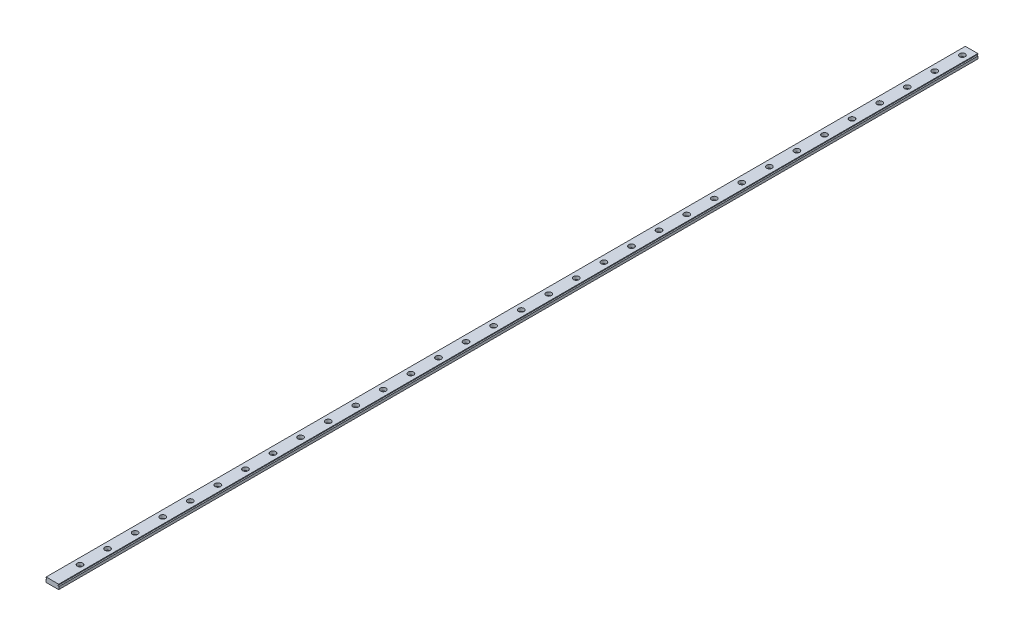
ISO-10303-21;
HEADER;
FILE_DESCRIPTION(('STEP AP214'),'2;1');
FILE_NAME('part.step','',(''),(''),'','','');
FILE_SCHEMA(('AUTOMOTIVE_DESIGN { 1 0 10303 214 1 1 1 1 }'));
ENDSEC;
DATA;
#1=APPLICATION_CONTEXT('core data for automotive mechanical design processes');
#2=APPLICATION_PROTOCOL_DEFINITION('international standard','automotive_design',2000,#1);
#3=PRODUCT_CONTEXT('',#1,'mechanical');
#4=PRODUCT('Part','Part','',(#3));
#5=PRODUCT_RELATED_PRODUCT_CATEGORY('part','',(#4));
#6=PRODUCT_DEFINITION_FORMATION('','',#4);
#7=PRODUCT_DEFINITION_CONTEXT('part definition',#1,'design');
#8=PRODUCT_DEFINITION('design','',#6,#7);
#9=PRODUCT_DEFINITION_SHAPE('','',#8);
#10=(LENGTH_UNIT() NAMED_UNIT(*) SI_UNIT(.MILLI.,.METRE.));
#11=(NAMED_UNIT(*) PLANE_ANGLE_UNIT() SI_UNIT($,.RADIAN.));
#12=(NAMED_UNIT(*) SI_UNIT($,.STERADIAN.) SOLID_ANGLE_UNIT());
#13=UNCERTAINTY_MEASURE_WITH_UNIT(LENGTH_MEASURE(1.E-05),#10,'distance_accuracy_value','');
#14=(GEOMETRIC_REPRESENTATION_CONTEXT(3) GLOBAL_UNCERTAINTY_ASSIGNED_CONTEXT((#13)) GLOBAL_UNIT_ASSIGNED_CONTEXT((#10,
#11,#12)) REPRESENTATION_CONTEXT('',''));
#15=CARTESIAN_POINT('',(0.,0.,0.));
#16=DIRECTION('',(0.,0.,1.));
#17=DIRECTION('',(1.,0.,0.));
#18=AXIS2_PLACEMENT_3D('',#15,#16,#17);
#19=CARTESIAN_POINT('',(6.8,2.48855722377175,1000.));
#20=DIRECTION('',(0.,-1.,0.));
#21=DIRECTION('',(0.,0.,-1.));
#22=AXIS2_PLACEMENT_3D('',#19,#20,#21);
#23=PLANE('',#22);
#24=CARTESIAN_POINT('',(0.,2.48855722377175,69.9999999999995));
#25=DIRECTION('',(0.,1.,0.));
#26=DIRECTION('',(0.,0.,1.));
#27=AXIS2_PLACEMENT_3D('',#24,#25,#26);
#28=CIRCLE('',#27,3.);
#29=CARTESIAN_POINT('',(0.,2.48855722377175,72.9999999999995));
#30=VERTEX_POINT('',#29);
#31=EDGE_CURVE('E1602',#30,#30,#28,.T.);
#32=ORIENTED_EDGE('',*,*,#31,.F.);
#33=EDGE_LOOP('',(#32));
#34=FACE_BOUND('',#33,.T.);
#35=CARTESIAN_POINT('',(0.,2.48855722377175,129.999999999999));
#36=DIRECTION('',(0.,1.,0.));
#37=DIRECTION('',(0.,0.,1.));
#38=AXIS2_PLACEMENT_3D('',#35,#36,#37);
#39=CIRCLE('',#38,3.);
#40=CARTESIAN_POINT('',(0.,2.48855722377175,132.999999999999));
#41=VERTEX_POINT('',#40);
#42=EDGE_CURVE('E1634',#41,#41,#39,.T.);
#43=ORIENTED_EDGE('',*,*,#42,.F.);
#44=EDGE_LOOP('',(#43));
#45=FACE_BOUND('',#44,.T.);
#46=CARTESIAN_POINT('',(0.,2.48855722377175,189.999999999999));
#47=DIRECTION('',(0.,1.,0.));
#48=DIRECTION('',(0.,0.,1.));
#49=AXIS2_PLACEMENT_3D('',#46,#47,#48);
#50=CIRCLE('',#49,3.);
#51=CARTESIAN_POINT('',(0.,2.48855722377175,192.999999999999));
#52=VERTEX_POINT('',#51);
#53=EDGE_CURVE('E1666',#52,#52,#50,.T.);
#54=ORIENTED_EDGE('',*,*,#53,.F.);
#55=EDGE_LOOP('',(#54));
#56=FACE_BOUND('',#55,.T.);
#57=CARTESIAN_POINT('',(0.,2.48855722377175,219.999999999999));
#58=DIRECTION('',(0.,1.,0.));
#59=DIRECTION('',(0.,0.,1.));
#60=AXIS2_PLACEMENT_3D('',#57,#58,#59);
#61=CIRCLE('',#60,3.);
#62=CARTESIAN_POINT('',(0.,2.48855722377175,222.999999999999));
#63=VERTEX_POINT('',#62);
#64=EDGE_CURVE('E1682',#63,#63,#61,.T.);
#65=ORIENTED_EDGE('',*,*,#64,.F.);
#66=EDGE_LOOP('',(#65));
#67=FACE_BOUND('',#66,.T.);
#68=CARTESIAN_POINT('',(0.,2.48855722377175,279.999999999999));
#69=DIRECTION('',(0.,1.,0.));
#70=DIRECTION('',(0.,0.,1.));
#71=AXIS2_PLACEMENT_3D('',#68,#69,#70);
#72=CIRCLE('',#71,3.);
#73=CARTESIAN_POINT('',(0.,2.48855722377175,282.999999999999));
#74=VERTEX_POINT('',#73);
#75=EDGE_CURVE('E1714',#74,#74,#72,.T.);
#76=ORIENTED_EDGE('',*,*,#75,.F.);
#77=EDGE_LOOP('',(#76));
#78=FACE_BOUND('',#77,.T.);
#79=CARTESIAN_POINT('',(0.,2.48855722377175,309.999999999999));
#80=DIRECTION('',(0.,1.,0.));
#81=DIRECTION('',(0.,0.,1.));
#82=AXIS2_PLACEMENT_3D('',#79,#80,#81);
#83=CIRCLE('',#82,3.);
#84=CARTESIAN_POINT('',(0.,2.48855722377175,312.999999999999));
#85=VERTEX_POINT('',#84);
#86=EDGE_CURVE('E1730',#85,#85,#83,.T.);
#87=ORIENTED_EDGE('',*,*,#86,.F.);
#88=EDGE_LOOP('',(#87));
#89=FACE_BOUND('',#88,.T.);
#90=CARTESIAN_POINT('',(0.,2.48855722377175,339.999999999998));
#91=DIRECTION('',(0.,1.,0.));
#92=DIRECTION('',(0.,0.,1.));
#93=AXIS2_PLACEMENT_3D('',#90,#91,#92);
#94=CIRCLE('',#93,3.);
#95=CARTESIAN_POINT('',(0.,2.48855722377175,342.999999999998));
#96=VERTEX_POINT('',#95);
#97=EDGE_CURVE('E1746',#96,#96,#94,.T.);
#98=ORIENTED_EDGE('',*,*,#97,.F.);
#99=EDGE_LOOP('',(#98));
#100=FACE_BOUND('',#99,.T.);
#101=CARTESIAN_POINT('',(0.,2.48855722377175,369.999999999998));
#102=DIRECTION('',(0.,1.,0.));
#103=DIRECTION('',(0.,0.,1.));
#104=AXIS2_PLACEMENT_3D('',#101,#102,#103);
#105=CIRCLE('',#104,3.);
#106=CARTESIAN_POINT('',(0.,2.48855722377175,372.999999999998));
#107=VERTEX_POINT('',#106);
#108=EDGE_CURVE('E1762',#107,#107,#105,.T.);
#109=ORIENTED_EDGE('',*,*,#108,.F.);
#110=EDGE_LOOP('',(#109));
#111=FACE_BOUND('',#110,.T.);
#112=CARTESIAN_POINT('',(0.,2.48855722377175,489.999999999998));
#113=DIRECTION('',(0.,1.,0.));
#114=DIRECTION('',(0.,0.,1.));
#115=AXIS2_PLACEMENT_3D('',#112,#113,#114);
#116=CIRCLE('',#115,3.);
#117=CARTESIAN_POINT('',(0.,2.48855722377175,492.999999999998));
#118=VERTEX_POINT('',#117);
#119=EDGE_CURVE('E1826',#118,#118,#116,.T.);
#120=ORIENTED_EDGE('',*,*,#119,.F.);
#121=EDGE_LOOP('',(#120));
#122=FACE_BOUND('',#121,.T.);
#123=CARTESIAN_POINT('',(0.,2.48855722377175,519.999999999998));
#124=DIRECTION('',(0.,1.,0.));
#125=DIRECTION('',(0.,0.,1.));
#126=AXIS2_PLACEMENT_3D('',#123,#124,#125);
#127=CIRCLE('',#126,3.);
#128=CARTESIAN_POINT('',(0.,2.48855722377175,522.999999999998));
#129=VERTEX_POINT('',#128);
#130=EDGE_CURVE('E1842',#129,#129,#127,.T.);
#131=ORIENTED_EDGE('',*,*,#130,.F.);
#132=EDGE_LOOP('',(#131));
#133=FACE_BOUND('',#132,.T.);
#134=CARTESIAN_POINT('',(0.,2.48855722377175,549.999999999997));
#135=DIRECTION('',(0.,1.,0.));
#136=DIRECTION('',(0.,0.,1.));
#137=AXIS2_PLACEMENT_3D('',#134,#135,#136);
#138=CIRCLE('',#137,3.);
#139=CARTESIAN_POINT('',(0.,2.48855722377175,552.999999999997));
#140=VERTEX_POINT('',#139);
#141=EDGE_CURVE('E1858',#140,#140,#138,.T.);
#142=ORIENTED_EDGE('',*,*,#141,.F.);
#143=EDGE_LOOP('',(#142));
#144=FACE_BOUND('',#143,.T.);
#145=CARTESIAN_POINT('',(0.,2.48855722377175,579.999999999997));
#146=DIRECTION('',(0.,1.,0.));
#147=DIRECTION('',(0.,0.,1.));
#148=AXIS2_PLACEMENT_3D('',#145,#146,#147);
#149=CIRCLE('',#148,3.);
#150=CARTESIAN_POINT('',(0.,2.48855722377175,582.999999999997));
#151=VERTEX_POINT('',#150);
#152=EDGE_CURVE('E1874',#151,#151,#149,.T.);
#153=ORIENTED_EDGE('',*,*,#152,.F.);
#154=EDGE_LOOP('',(#153));
#155=FACE_BOUND('',#154,.T.);
#156=CARTESIAN_POINT('',(0.,2.48855722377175,609.999999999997));
#157=DIRECTION('',(0.,1.,0.));
#158=DIRECTION('',(0.,0.,1.));
#159=AXIS2_PLACEMENT_3D('',#156,#157,#158);
#160=CIRCLE('',#159,3.);
#161=CARTESIAN_POINT('',(0.,2.48855722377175,612.999999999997));
#162=VERTEX_POINT('',#161);
#163=EDGE_CURVE('E1890',#162,#162,#160,.T.);
#164=ORIENTED_EDGE('',*,*,#163,.F.);
#165=EDGE_LOOP('',(#164));
#166=FACE_BOUND('',#165,.T.);
#167=CARTESIAN_POINT('',(0.,2.48855722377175,639.999999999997));
#168=DIRECTION('',(0.,1.,0.));
#169=DIRECTION('',(0.,0.,1.));
#170=AXIS2_PLACEMENT_3D('',#167,#168,#169);
#171=CIRCLE('',#170,3.);
#172=CARTESIAN_POINT('',(0.,2.48855722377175,642.999999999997));
#173=VERTEX_POINT('',#172);
#174=EDGE_CURVE('E1906',#173,#173,#171,.T.);
#175=ORIENTED_EDGE('',*,*,#174,.F.);
#176=EDGE_LOOP('',(#175));
#177=FACE_BOUND('',#176,.T.);
#178=CARTESIAN_POINT('',(0.,2.48855722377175,669.999999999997));
#179=DIRECTION('',(0.,1.,0.));
#180=DIRECTION('',(0.,0.,1.));
#181=AXIS2_PLACEMENT_3D('',#178,#179,#180);
#182=CIRCLE('',#181,3.);
#183=CARTESIAN_POINT('',(0.,2.48855722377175,672.999999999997));
#184=VERTEX_POINT('',#183);
#185=EDGE_CURVE('E1922',#184,#184,#182,.T.);
#186=ORIENTED_EDGE('',*,*,#185,.F.);
#187=EDGE_LOOP('',(#186));
#188=FACE_BOUND('',#187,.T.);
#189=CARTESIAN_POINT('',(0.,2.48855722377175,699.999999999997));
#190=DIRECTION('',(0.,1.,0.));
#191=DIRECTION('',(0.,0.,1.));
#192=AXIS2_PLACEMENT_3D('',#189,#190,#191);
#193=CIRCLE('',#192,3.);
#194=CARTESIAN_POINT('',(0.,2.48855722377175,702.999999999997));
#195=VERTEX_POINT('',#194);
#196=EDGE_CURVE('E1938',#195,#195,#193,.T.);
#197=ORIENTED_EDGE('',*,*,#196,.F.);
#198=EDGE_LOOP('',(#197));
#199=FACE_BOUND('',#198,.T.);
#200=CARTESIAN_POINT('',(0.,2.48855722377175,729.999999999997));
#201=DIRECTION('',(0.,1.,0.));
#202=DIRECTION('',(0.,0.,1.));
#203=AXIS2_PLACEMENT_3D('',#200,#201,#202);
#204=CIRCLE('',#203,3.);
#205=CARTESIAN_POINT('',(0.,2.48855722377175,732.999999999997));
#206=VERTEX_POINT('',#205);
#207=EDGE_CURVE('E1954',#206,#206,#204,.T.);
#208=ORIENTED_EDGE('',*,*,#207,.F.);
#209=EDGE_LOOP('',(#208));
#210=FACE_BOUND('',#209,.T.);
#211=CARTESIAN_POINT('',(0.,2.48855722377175,759.999999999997));
#212=DIRECTION('',(0.,1.,0.));
#213=DIRECTION('',(0.,0.,1.));
#214=AXIS2_PLACEMENT_3D('',#211,#212,#213);
#215=CIRCLE('',#214,3.);
#216=CARTESIAN_POINT('',(0.,2.48855722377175,762.999999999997));
#217=VERTEX_POINT('',#216);
#218=EDGE_CURVE('E1970',#217,#217,#215,.T.);
#219=ORIENTED_EDGE('',*,*,#218,.F.);
#220=EDGE_LOOP('',(#219));
#221=FACE_BOUND('',#220,.T.);
#222=CARTESIAN_POINT('',(0.,2.48855722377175,789.999999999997));
#223=DIRECTION('',(0.,1.,0.));
#224=DIRECTION('',(0.,0.,1.));
#225=AXIS2_PLACEMENT_3D('',#222,#223,#224);
#226=CIRCLE('',#225,3.);
#227=CARTESIAN_POINT('',(0.,2.48855722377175,792.999999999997));
#228=VERTEX_POINT('',#227);
#229=EDGE_CURVE('E1986',#228,#228,#226,.T.);
#230=ORIENTED_EDGE('',*,*,#229,.F.);
#231=EDGE_LOOP('',(#230));
#232=FACE_BOUND('',#231,.T.);
#233=CARTESIAN_POINT('',(0.,2.48855722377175,819.999999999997));
#234=DIRECTION('',(0.,1.,0.));
#235=DIRECTION('',(0.,0.,1.));
#236=AXIS2_PLACEMENT_3D('',#233,#234,#235);
#237=CIRCLE('',#236,3.);
#238=CARTESIAN_POINT('',(0.,2.48855722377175,822.999999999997));
#239=VERTEX_POINT('',#238);
#240=EDGE_CURVE('E2002',#239,#239,#237,.T.);
#241=ORIENTED_EDGE('',*,*,#240,.F.);
#242=EDGE_LOOP('',(#241));
#243=FACE_BOUND('',#242,.T.);
#244=CARTESIAN_POINT('',(0.,2.48855722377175,849.999999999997));
#245=DIRECTION('',(0.,1.,0.));
#246=DIRECTION('',(0.,0.,1.));
#247=AXIS2_PLACEMENT_3D('',#244,#245,#246);
#248=CIRCLE('',#247,3.);
#249=CARTESIAN_POINT('',(0.,2.48855722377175,852.999999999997));
#250=VERTEX_POINT('',#249);
#251=EDGE_CURVE('E2018',#250,#250,#248,.T.);
#252=ORIENTED_EDGE('',*,*,#251,.F.);
#253=EDGE_LOOP('',(#252));
#254=FACE_BOUND('',#253,.T.);
#255=CARTESIAN_POINT('',(0.,2.48855722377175,879.999999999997));
#256=DIRECTION('',(0.,1.,0.));
#257=DIRECTION('',(0.,0.,1.));
#258=AXIS2_PLACEMENT_3D('',#255,#256,#257);
#259=CIRCLE('',#258,3.);
#260=CARTESIAN_POINT('',(0.,2.48855722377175,882.999999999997));
#261=VERTEX_POINT('',#260);
#262=EDGE_CURVE('E2034',#261,#261,#259,.T.);
#263=ORIENTED_EDGE('',*,*,#262,.F.);
#264=EDGE_LOOP('',(#263));
#265=FACE_BOUND('',#264,.T.);
#266=CARTESIAN_POINT('',(0.,2.48855722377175,909.999999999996));
#267=DIRECTION('',(0.,1.,0.));
#268=DIRECTION('',(0.,0.,1.));
#269=AXIS2_PLACEMENT_3D('',#266,#267,#268);
#270=CIRCLE('',#269,3.);
#271=CARTESIAN_POINT('',(0.,2.48855722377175,912.999999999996));
#272=VERTEX_POINT('',#271);
#273=EDGE_CURVE('E2050',#272,#272,#270,.T.);
#274=ORIENTED_EDGE('',*,*,#273,.F.);
#275=EDGE_LOOP('',(#274));
#276=FACE_BOUND('',#275,.T.);
#277=CARTESIAN_POINT('',(0.,2.48855722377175,939.999999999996));
#278=DIRECTION('',(0.,1.,0.));
#279=DIRECTION('',(0.,0.,1.));
#280=AXIS2_PLACEMENT_3D('',#277,#278,#279);
#281=CIRCLE('',#280,3.);
#282=CARTESIAN_POINT('',(0.,2.48855722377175,942.999999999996));
#283=VERTEX_POINT('',#282);
#284=EDGE_CURVE('E2066',#283,#283,#281,.T.);
#285=ORIENTED_EDGE('',*,*,#284,.F.);
#286=EDGE_LOOP('',(#285));
#287=FACE_BOUND('',#286,.T.);
#288=CARTESIAN_POINT('',(0.,2.48855722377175,10.));
#289=DIRECTION('',(0.,1.,0.));
#290=DIRECTION('',(0.,0.,1.));
#291=AXIS2_PLACEMENT_3D('',#288,#289,#290);
#292=CIRCLE('',#291,3.);
#293=CARTESIAN_POINT('',(0.,2.48855722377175,13.));
#294=VERTEX_POINT('',#293);
#295=EDGE_CURVE('E2098',#294,#294,#292,.T.);
#296=ORIENTED_EDGE('',*,*,#295,.F.);
#297=EDGE_LOOP('',(#296));
#298=FACE_BOUND('',#297,.T.);
#299=DIRECTION('',(-1.,0.,0.));
#300=VECTOR('',#299,1.);
#301=CARTESIAN_POINT('',(6.8,2.48855722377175,0.));
#302=LINE('',#301,#300);
#303=CARTESIAN_POINT('',(6.8,2.48855722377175,0.));
#304=VERTEX_POINT('',#303);
#305=CARTESIAN_POINT('',(-6.8,2.48855722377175,0.));
#306=VERTEX_POINT('',#305);
#307=EDGE_CURVE('E158',#304,#306,#302,.T.);
#308=ORIENTED_EDGE('',*,*,#307,.T.);
#309=DIRECTION('',(0.,0.,-1.));
#310=VECTOR('',#309,1.);
#311=CARTESIAN_POINT('',(-6.8,2.48855722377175,1000.));
#312=LINE('',#311,#310);
#313=CARTESIAN_POINT('',(-6.8,2.48855722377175,1000.));
#314=VERTEX_POINT('',#313);
#315=EDGE_CURVE('E155',#314,#306,#312,.T.);
#316=ORIENTED_EDGE('',*,*,#315,.F.);
#317=DIRECTION('',(-1.,0.,0.));
#318=VECTOR('',#317,1.);
#319=CARTESIAN_POINT('',(6.8,2.48855722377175,1000.));
#320=LINE('',#319,#318);
#321=CARTESIAN_POINT('',(6.8,2.48855722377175,1000.));
#322=VERTEX_POINT('',#321);
#323=EDGE_CURVE('E143',#322,#314,#320,.T.);
#324=ORIENTED_EDGE('',*,*,#323,.F.);
#325=DIRECTION('',(0.,0.,-1.));
#326=VECTOR('',#325,1.);
#327=CARTESIAN_POINT('',(6.8,2.48855722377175,1000.));
#328=LINE('',#327,#326);
#329=EDGE_CURVE('E160',#322,#304,#328,.T.);
#330=ORIENTED_EDGE('',*,*,#329,.T.);
#331=EDGE_LOOP('',(#308,#316,#324,#330));
#332=FACE_BOUND('',#331,.T.);
#333=CARTESIAN_POINT('',(0.,2.48855722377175,969.999999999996));
#334=DIRECTION('',(0.,1.,0.));
#335=DIRECTION('',(0.,0.,1.));
#336=AXIS2_PLACEMENT_3D('',#333,#334,#335);
#337=CIRCLE('',#336,3.);
#338=CARTESIAN_POINT('',(0.,2.48855722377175,972.999999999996));
#339=VERTEX_POINT('',#338);
#340=EDGE_CURVE('E2082',#339,#339,#337,.T.);
#341=ORIENTED_EDGE('',*,*,#340,.F.);
#342=EDGE_LOOP('',(#341));
#343=FACE_BOUND('',#342,.T.);
#344=CARTESIAN_POINT('',(0.,2.48855722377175,459.999999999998));
#345=DIRECTION('',(0.,1.,0.));
#346=DIRECTION('',(0.,0.,1.));
#347=AXIS2_PLACEMENT_3D('',#344,#345,#346);
#348=CIRCLE('',#347,3.);
#349=CARTESIAN_POINT('',(0.,2.48855722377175,462.999999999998));
#350=VERTEX_POINT('',#349);
#351=EDGE_CURVE('E1810',#350,#350,#348,.T.);
#352=ORIENTED_EDGE('',*,*,#351,.F.);
#353=EDGE_LOOP('',(#352));
#354=FACE_BOUND('',#353,.T.);
#355=CARTESIAN_POINT('',(0.,2.48855722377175,429.999999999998));
#356=DIRECTION('',(0.,1.,0.));
#357=DIRECTION('',(0.,0.,1.));
#358=AXIS2_PLACEMENT_3D('',#355,#356,#357);
#359=CIRCLE('',#358,3.);
#360=CARTESIAN_POINT('',(0.,2.48855722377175,432.999999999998));
#361=VERTEX_POINT('',#360);
#362=EDGE_CURVE('E1794',#361,#361,#359,.T.);
#363=ORIENTED_EDGE('',*,*,#362,.F.);
#364=EDGE_LOOP('',(#363));
#365=FACE_BOUND('',#364,.T.);
#366=CARTESIAN_POINT('',(0.,2.48855722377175,399.999999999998));
#367=DIRECTION('',(0.,1.,0.));
#368=DIRECTION('',(0.,0.,1.));
#369=AXIS2_PLACEMENT_3D('',#366,#367,#368);
#370=CIRCLE('',#369,3.);
#371=CARTESIAN_POINT('',(0.,2.48855722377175,402.999999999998));
#372=VERTEX_POINT('',#371);
#373=EDGE_CURVE('E1778',#372,#372,#370,.T.);
#374=ORIENTED_EDGE('',*,*,#373,.F.);
#375=EDGE_LOOP('',(#374));
#376=FACE_BOUND('',#375,.T.);
#377=CARTESIAN_POINT('',(0.,2.48855722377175,249.999999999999));
#378=DIRECTION('',(0.,1.,0.));
#379=DIRECTION('',(0.,0.,1.));
#380=AXIS2_PLACEMENT_3D('',#377,#378,#379);
#381=CIRCLE('',#380,3.);
#382=CARTESIAN_POINT('',(0.,2.48855722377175,252.999999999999));
#383=VERTEX_POINT('',#382);
#384=EDGE_CURVE('E1698',#383,#383,#381,.T.);
#385=ORIENTED_EDGE('',*,*,#384,.F.);
#386=EDGE_LOOP('',(#385));
#387=FACE_BOUND('',#386,.T.);
#388=CARTESIAN_POINT('',(0.,2.48855722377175,159.999999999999));
#389=DIRECTION('',(0.,1.,0.));
#390=DIRECTION('',(0.,0.,1.));
#391=AXIS2_PLACEMENT_3D('',#388,#389,#390);
#392=CIRCLE('',#391,3.);
#393=CARTESIAN_POINT('',(0.,2.48855722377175,162.999999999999));
#394=VERTEX_POINT('',#393);
#395=EDGE_CURVE('E1650',#394,#394,#392,.T.);
#396=ORIENTED_EDGE('',*,*,#395,.F.);
#397=EDGE_LOOP('',(#396));
#398=FACE_BOUND('',#397,.T.);
#399=CARTESIAN_POINT('',(0.,2.48855722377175,99.9999999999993));
#400=DIRECTION('',(0.,1.,0.));
#401=DIRECTION('',(0.,0.,1.));
#402=AXIS2_PLACEMENT_3D('',#399,#400,#401);
#403=CIRCLE('',#402,3.);
#404=CARTESIAN_POINT('',(0.,2.48855722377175,102.999999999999));
#405=VERTEX_POINT('',#404);
#406=EDGE_CURVE('E1618',#405,#405,#403,.T.);
#407=ORIENTED_EDGE('',*,*,#406,.F.);
#408=EDGE_LOOP('',(#407));
#409=FACE_BOUND('',#408,.T.);
#410=CARTESIAN_POINT('',(0.,2.48855722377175,39.9999999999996));
#411=DIRECTION('',(0.,1.,0.));
#412=DIRECTION('',(0.,0.,1.));
#413=AXIS2_PLACEMENT_3D('',#410,#411,#412);
#414=CIRCLE('',#413,3.);
#415=CARTESIAN_POINT('',(0.,2.48855722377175,42.9999999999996));
#416=VERTEX_POINT('',#415);
#417=EDGE_CURVE('E1587',#416,#416,#414,.T.);
#418=ORIENTED_EDGE('',*,*,#417,.F.);
#419=EDGE_LOOP('',(#418));
#420=FACE_BOUND('',#419,.T.);
#421=ADVANCED_FACE('F45',(#34,#45,#56,#67,#78,#89,#100,#111,#122,#133,#144,#155,#166,#177,#188,
#199,#210,#221,#232,#243,#254,#265,#276,#287,#298,#332,#343,#354,#365,#376,#387,#398,#409,#420),
#23,.F.);
#422=CARTESIAN_POINT('',(-7.,1.03855722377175,1000.));
#423=DIRECTION('',(0.,0.,-1.));
#424=DIRECTION('',(-1.,0.,0.));
#425=AXIS2_PLACEMENT_3D('',#422,#423,#424);
#426=CYLINDRICAL_SURFACE('',#425,0.75);
#427=CARTESIAN_POINT('',(-7.,1.03855722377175,0.));
#428=DIRECTION('',(0.,0.,-1.));
#429=DIRECTION('',(1.,0.,0.));
#430=AXIS2_PLACEMENT_3D('',#427,#428,#429);
#431=CIRCLE('',#430,0.75);
#432=CARTESIAN_POINT('',(-7.,1.78855722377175,0.));
#433=VERTEX_POINT('',#432);
#434=CARTESIAN_POINT('',(-7.,0.288557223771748,0.));
#435=VERTEX_POINT('',#434);
#436=EDGE_CURVE('E171',#433,#435,#431,.T.);
#437=ORIENTED_EDGE('',*,*,#436,.T.);
#438=DIRECTION('',(0.,0.,-1.));
#439=VECTOR('',#438,1.);
#440=CARTESIAN_POINT('',(-7.,0.288557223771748,1000.));
#441=LINE('',#440,#439);
#442=CARTESIAN_POINT('',(-7.,0.288557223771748,1000.));
#443=VERTEX_POINT('',#442);
#444=EDGE_CURVE('E12',#443,#435,#441,.T.);
#445=ORIENTED_EDGE('',*,*,#444,.F.);
#446=CARTESIAN_POINT('',(-7.,1.03855722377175,1000.));
#447=DIRECTION('',(0.,0.,-1.));
#448=DIRECTION('',(1.,0.,0.));
#449=AXIS2_PLACEMENT_3D('',#446,#447,#448);
#450=CIRCLE('',#449,0.75);
#451=CARTESIAN_POINT('',(-7.,1.78855722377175,1000.));
#452=VERTEX_POINT('',#451);
#453=EDGE_CURVE('E208',#452,#443,#450,.T.);
#454=ORIENTED_EDGE('',*,*,#453,.F.);
#455=DIRECTION('',(0.,0.,-1.));
#456=VECTOR('',#455,1.);
#457=CARTESIAN_POINT('',(-7.,1.78855722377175,1000.));
#458=LINE('',#457,#456);
#459=EDGE_CURVE('E167',#452,#433,#458,.T.);
#460=ORIENTED_EDGE('',*,*,#459,.T.);
#461=EDGE_LOOP('',(#437,#445,#454,#460));
#462=FACE_BOUND('',#461,.T.);
#463=ADVANCED_FACE('F47',(#462),#426,.F.);
#464=CARTESIAN_POINT('',(-7.,0.288557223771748,1000.));
#465=DIRECTION('',(1.,0.,0.));
#466=DIRECTION('',(0.,0.,-1.));
#467=AXIS2_PLACEMENT_3D('',#464,#465,#466);
#468=PLANE('',#467);
#469=DIRECTION('',(0.,-1.,0.));
#470=VECTOR('',#469,1.);
#471=CARTESIAN_POINT('',(-7.,0.288557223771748,0.));
#472=LINE('',#471,#470);
#473=CARTESIAN_POINT('',(-7.,-2.51144277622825,0.));
#474=VERTEX_POINT('',#473);
#475=EDGE_CURVE('E175',#435,#474,#472,.T.);
#476=ORIENTED_EDGE('',*,*,#475,.T.);
#477=DIRECTION('',(0.,0.,-1.));
#478=VECTOR('',#477,1.);
#479=CARTESIAN_POINT('',(-7.,-2.51144277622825,1000.));
#480=LINE('',#479,#478);
#481=CARTESIAN_POINT('',(-7.,-2.51144277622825,1000.));
#482=VERTEX_POINT('',#481);
#483=EDGE_CURVE('E55',#482,#474,#480,.T.);
#484=ORIENTED_EDGE('',*,*,#483,.F.);
#485=DIRECTION('',(0.,-1.,0.));
#486=VECTOR('',#485,1.);
#487=CARTESIAN_POINT('',(-7.,0.288557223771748,1000.));
#488=LINE('',#487,#486);
#489=EDGE_CURVE('E118',#443,#482,#488,.T.);
#490=ORIENTED_EDGE('',*,*,#489,.F.);
#491=ORIENTED_EDGE('',*,*,#444,.T.);
#492=EDGE_LOOP('',(#476,#484,#490,#491));
#493=FACE_BOUND('',#492,.T.);
#494=ADVANCED_FACE('F306',(#493),#468,.F.);
#495=CARTESIAN_POINT('',(-7.,-2.51144277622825,1000.));
#496=DIRECTION('',(0.707106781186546,0.707106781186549,0.));
#497=DIRECTION('',(-0.707106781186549,0.707106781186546,0.));
#498=AXIS2_PLACEMENT_3D('',#495,#496,#497);
#499=PLANE('',#498);
#500=DIRECTION('',(0.707106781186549,-0.707106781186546,0.));
#501=VECTOR('',#500,1.);
#502=CARTESIAN_POINT('',(-7.,-2.51144277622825,0.));
#503=LINE('',#502,#501);
#504=CARTESIAN_POINT('',(-6.8,-2.71144277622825,0.));
#505=VERTEX_POINT('',#504);
#506=EDGE_CURVE('E179',#474,#505,#503,.T.);
#507=ORIENTED_EDGE('',*,*,#506,.T.);
#508=DIRECTION('',(0.,0.,-1.));
#509=VECTOR('',#508,1.);
#510=CARTESIAN_POINT('',(-6.8,-2.71144277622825,1000.));
#511=LINE('',#510,#509);
#512=CARTESIAN_POINT('',(-6.8,-2.71144277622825,1000.));
#513=VERTEX_POINT('',#512);
#514=EDGE_CURVE('E235',#513,#505,#511,.T.);
#515=ORIENTED_EDGE('',*,*,#514,.F.);
#516=DIRECTION('',(0.707106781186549,-0.707106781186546,0.));
#517=VECTOR('',#516,1.);
#518=CARTESIAN_POINT('',(-7.,-2.51144277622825,1000.));
#519=LINE('',#518,#517);
#520=EDGE_CURVE('E245',#482,#513,#519,.T.);
#521=ORIENTED_EDGE('',*,*,#520,.F.);
#522=ORIENTED_EDGE('',*,*,#483,.T.);
#523=EDGE_LOOP('',(#507,#515,#521,#522));
#524=FACE_BOUND('',#523,.T.);
#525=ADVANCED_FACE('F243',(#524),#499,.F.);
#526=CARTESIAN_POINT('',(3.8,-2.71144277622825,1000.));
#527=DIRECTION('',(0.,1.,0.));
#528=DIRECTION('',(-1.,0.,0.));
#529=AXIS2_PLACEMENT_3D('',#526,#527,#528);
#530=PLANE('',#529);
#531=CARTESIAN_POINT('',(0.,-2.71144277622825,39.9999999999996));
#532=DIRECTION('',(0.,1.,0.));
#533=DIRECTION('',(0.,0.,1.));
#534=AXIS2_PLACEMENT_3D('',#531,#532,#533);
#535=CIRCLE('',#534,1.75);
#536=CARTESIAN_POINT('',(0.,-2.71144277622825,41.7499999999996));
#537=VERTEX_POINT('',#536);
#538=EDGE_CURVE('E1598',#537,#537,#535,.T.);
#539=ORIENTED_EDGE('',*,*,#538,.T.);
#540=EDGE_LOOP('',(#539));
#541=FACE_BOUND('',#540,.T.);
#542=CARTESIAN_POINT('',(0.,-2.71144277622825,69.9999999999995));
#543=DIRECTION('',(0.,1.,0.));
#544=DIRECTION('',(0.,0.,1.));
#545=AXIS2_PLACEMENT_3D('',#542,#543,#544);
#546=CIRCLE('',#545,1.75);
#547=CARTESIAN_POINT('',(0.,-2.71144277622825,71.7499999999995));
#548=VERTEX_POINT('',#547);
#549=EDGE_CURVE('E1614',#548,#548,#546,.T.);
#550=ORIENTED_EDGE('',*,*,#549,.T.);
#551=EDGE_LOOP('',(#550));
#552=FACE_BOUND('',#551,.T.);
#553=CARTESIAN_POINT('',(0.,-2.71144277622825,99.9999999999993));
#554=DIRECTION('',(0.,1.,0.));
#555=DIRECTION('',(0.,0.,1.));
#556=AXIS2_PLACEMENT_3D('',#553,#554,#555);
#557=CIRCLE('',#556,1.75);
#558=CARTESIAN_POINT('',(0.,-2.71144277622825,101.749999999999));
#559=VERTEX_POINT('',#558);
#560=EDGE_CURVE('E1630',#559,#559,#557,.T.);
#561=ORIENTED_EDGE('',*,*,#560,.T.);
#562=EDGE_LOOP('',(#561));
#563=FACE_BOUND('',#562,.T.);
#564=CARTESIAN_POINT('',(0.,-2.71144277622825,129.999999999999));
#565=DIRECTION('',(0.,1.,0.));
#566=DIRECTION('',(0.,0.,1.));
#567=AXIS2_PLACEMENT_3D('',#564,#565,#566);
#568=CIRCLE('',#567,1.75);
#569=CARTESIAN_POINT('',(0.,-2.71144277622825,131.749999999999));
#570=VERTEX_POINT('',#569);
#571=EDGE_CURVE('E1646',#570,#570,#568,.T.);
#572=ORIENTED_EDGE('',*,*,#571,.T.);
#573=EDGE_LOOP('',(#572));
#574=FACE_BOUND('',#573,.T.);
#575=CARTESIAN_POINT('',(0.,-2.71144277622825,159.999999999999));
#576=DIRECTION('',(0.,1.,0.));
#577=DIRECTION('',(0.,0.,1.));
#578=AXIS2_PLACEMENT_3D('',#575,#576,#577);
#579=CIRCLE('',#578,1.75);
#580=CARTESIAN_POINT('',(0.,-2.71144277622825,161.749999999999));
#581=VERTEX_POINT('',#580);
#582=EDGE_CURVE('E1662',#581,#581,#579,.T.);
#583=ORIENTED_EDGE('',*,*,#582,.T.);
#584=EDGE_LOOP('',(#583));
#585=FACE_BOUND('',#584,.T.);
#586=CARTESIAN_POINT('',(0.,-2.71144277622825,189.999999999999));
#587=DIRECTION('',(0.,1.,0.));
#588=DIRECTION('',(0.,0.,1.));
#589=AXIS2_PLACEMENT_3D('',#586,#587,#588);
#590=CIRCLE('',#589,1.75);
#591=CARTESIAN_POINT('',(0.,-2.71144277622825,191.749999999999));
#592=VERTEX_POINT('',#591);
#593=EDGE_CURVE('E1678',#592,#592,#590,.T.);
#594=ORIENTED_EDGE('',*,*,#593,.T.);
#595=EDGE_LOOP('',(#594));
#596=FACE_BOUND('',#595,.T.);
#597=CARTESIAN_POINT('',(0.,-2.71144277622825,219.999999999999));
#598=DIRECTION('',(0.,1.,0.));
#599=DIRECTION('',(0.,0.,1.));
#600=AXIS2_PLACEMENT_3D('',#597,#598,#599);
#601=CIRCLE('',#600,1.75);
#602=CARTESIAN_POINT('',(0.,-2.71144277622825,221.749999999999));
#603=VERTEX_POINT('',#602);
#604=EDGE_CURVE('E1694',#603,#603,#601,.T.);
#605=ORIENTED_EDGE('',*,*,#604,.T.);
#606=EDGE_LOOP('',(#605));
#607=FACE_BOUND('',#606,.T.);
#608=CARTESIAN_POINT('',(0.,-2.71144277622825,249.999999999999));
#609=DIRECTION('',(0.,1.,0.));
#610=DIRECTION('',(0.,0.,1.));
#611=AXIS2_PLACEMENT_3D('',#608,#609,#610);
#612=CIRCLE('',#611,1.75);
#613=CARTESIAN_POINT('',(0.,-2.71144277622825,251.749999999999));
#614=VERTEX_POINT('',#613);
#615=EDGE_CURVE('E1710',#614,#614,#612,.T.);
#616=ORIENTED_EDGE('',*,*,#615,.T.);
#617=EDGE_LOOP('',(#616));
#618=FACE_BOUND('',#617,.T.);
#619=CARTESIAN_POINT('',(0.,-2.71144277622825,279.999999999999));
#620=DIRECTION('',(0.,1.,0.));
#621=DIRECTION('',(0.,0.,1.));
#622=AXIS2_PLACEMENT_3D('',#619,#620,#621);
#623=CIRCLE('',#622,1.75);
#624=CARTESIAN_POINT('',(0.,-2.71144277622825,281.749999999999));
#625=VERTEX_POINT('',#624);
#626=EDGE_CURVE('E1726',#625,#625,#623,.T.);
#627=ORIENTED_EDGE('',*,*,#626,.T.);
#628=EDGE_LOOP('',(#627));
#629=FACE_BOUND('',#628,.T.);
#630=CARTESIAN_POINT('',(0.,-2.71144277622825,309.999999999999));
#631=DIRECTION('',(0.,1.,0.));
#632=DIRECTION('',(0.,0.,1.));
#633=AXIS2_PLACEMENT_3D('',#630,#631,#632);
#634=CIRCLE('',#633,1.75);
#635=CARTESIAN_POINT('',(0.,-2.71144277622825,311.749999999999));
#636=VERTEX_POINT('',#635);
#637=EDGE_CURVE('E1742',#636,#636,#634,.T.);
#638=ORIENTED_EDGE('',*,*,#637,.T.);
#639=EDGE_LOOP('',(#638));
#640=FACE_BOUND('',#639,.T.);
#641=CARTESIAN_POINT('',(0.,-2.71144277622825,339.999999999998));
#642=DIRECTION('',(0.,1.,0.));
#643=DIRECTION('',(0.,0.,1.));
#644=AXIS2_PLACEMENT_3D('',#641,#642,#643);
#645=CIRCLE('',#644,1.75);
#646=CARTESIAN_POINT('',(0.,-2.71144277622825,341.749999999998));
#647=VERTEX_POINT('',#646);
#648=EDGE_CURVE('E1758',#647,#647,#645,.T.);
#649=ORIENTED_EDGE('',*,*,#648,.T.);
#650=EDGE_LOOP('',(#649));
#651=FACE_BOUND('',#650,.T.);
#652=CARTESIAN_POINT('',(0.,-2.71144277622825,369.999999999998));
#653=DIRECTION('',(0.,1.,0.));
#654=DIRECTION('',(0.,0.,1.));
#655=AXIS2_PLACEMENT_3D('',#652,#653,#654);
#656=CIRCLE('',#655,1.75);
#657=CARTESIAN_POINT('',(0.,-2.71144277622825,371.749999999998));
#658=VERTEX_POINT('',#657);
#659=EDGE_CURVE('E1774',#658,#658,#656,.T.);
#660=ORIENTED_EDGE('',*,*,#659,.T.);
#661=EDGE_LOOP('',(#660));
#662=FACE_BOUND('',#661,.T.);
#663=CARTESIAN_POINT('',(0.,-2.71144277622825,399.999999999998));
#664=DIRECTION('',(0.,1.,0.));
#665=DIRECTION('',(0.,0.,1.));
#666=AXIS2_PLACEMENT_3D('',#663,#664,#665);
#667=CIRCLE('',#666,1.75);
#668=CARTESIAN_POINT('',(0.,-2.71144277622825,401.749999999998));
#669=VERTEX_POINT('',#668);
#670=EDGE_CURVE('E1790',#669,#669,#667,.T.);
#671=ORIENTED_EDGE('',*,*,#670,.T.);
#672=EDGE_LOOP('',(#671));
#673=FACE_BOUND('',#672,.T.);
#674=CARTESIAN_POINT('',(0.,-2.71144277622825,429.999999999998));
#675=DIRECTION('',(0.,1.,0.));
#676=DIRECTION('',(0.,0.,1.));
#677=AXIS2_PLACEMENT_3D('',#674,#675,#676);
#678=CIRCLE('',#677,1.75);
#679=CARTESIAN_POINT('',(0.,-2.71144277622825,431.749999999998));
#680=VERTEX_POINT('',#679);
#681=EDGE_CURVE('E1806',#680,#680,#678,.T.);
#682=ORIENTED_EDGE('',*,*,#681,.T.);
#683=EDGE_LOOP('',(#682));
#684=FACE_BOUND('',#683,.T.);
#685=CARTESIAN_POINT('',(0.,-2.71144277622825,459.999999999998));
#686=DIRECTION('',(0.,1.,0.));
#687=DIRECTION('',(0.,0.,1.));
#688=AXIS2_PLACEMENT_3D('',#685,#686,#687);
#689=CIRCLE('',#688,1.75);
#690=CARTESIAN_POINT('',(0.,-2.71144277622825,461.749999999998));
#691=VERTEX_POINT('',#690);
#692=EDGE_CURVE('E1822',#691,#691,#689,.T.);
#693=ORIENTED_EDGE('',*,*,#692,.T.);
#694=EDGE_LOOP('',(#693));
#695=FACE_BOUND('',#694,.T.);
#696=CARTESIAN_POINT('',(0.,-2.71144277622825,489.999999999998));
#697=DIRECTION('',(0.,1.,0.));
#698=DIRECTION('',(0.,0.,1.));
#699=AXIS2_PLACEMENT_3D('',#696,#697,#698);
#700=CIRCLE('',#699,1.75);
#701=CARTESIAN_POINT('',(0.,-2.71144277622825,491.749999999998));
#702=VERTEX_POINT('',#701);
#703=EDGE_CURVE('E1838',#702,#702,#700,.T.);
#704=ORIENTED_EDGE('',*,*,#703,.T.);
#705=EDGE_LOOP('',(#704));
#706=FACE_BOUND('',#705,.T.);
#707=CARTESIAN_POINT('',(0.,-2.71144277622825,519.999999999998));
#708=DIRECTION('',(0.,1.,0.));
#709=DIRECTION('',(0.,0.,1.));
#710=AXIS2_PLACEMENT_3D('',#707,#708,#709);
#711=CIRCLE('',#710,1.75);
#712=CARTESIAN_POINT('',(0.,-2.71144277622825,521.749999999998));
#713=VERTEX_POINT('',#712);
#714=EDGE_CURVE('E1854',#713,#713,#711,.T.);
#715=ORIENTED_EDGE('',*,*,#714,.T.);
#716=EDGE_LOOP('',(#715));
#717=FACE_BOUND('',#716,.T.);
#718=CARTESIAN_POINT('',(0.,-2.71144277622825,549.999999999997));
#719=DIRECTION('',(0.,1.,0.));
#720=DIRECTION('',(0.,0.,1.));
#721=AXIS2_PLACEMENT_3D('',#718,#719,#720);
#722=CIRCLE('',#721,1.75);
#723=CARTESIAN_POINT('',(0.,-2.71144277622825,551.749999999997));
#724=VERTEX_POINT('',#723);
#725=EDGE_CURVE('E1870',#724,#724,#722,.T.);
#726=ORIENTED_EDGE('',*,*,#725,.T.);
#727=EDGE_LOOP('',(#726));
#728=FACE_BOUND('',#727,.T.);
#729=CARTESIAN_POINT('',(0.,-2.71144277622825,579.999999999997));
#730=DIRECTION('',(0.,1.,0.));
#731=DIRECTION('',(0.,0.,1.));
#732=AXIS2_PLACEMENT_3D('',#729,#730,#731);
#733=CIRCLE('',#732,1.75);
#734=CARTESIAN_POINT('',(0.,-2.71144277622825,581.749999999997));
#735=VERTEX_POINT('',#734);
#736=EDGE_CURVE('E1886',#735,#735,#733,.T.);
#737=ORIENTED_EDGE('',*,*,#736,.T.);
#738=EDGE_LOOP('',(#737));
#739=FACE_BOUND('',#738,.T.);
#740=CARTESIAN_POINT('',(0.,-2.71144277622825,609.999999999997));
#741=DIRECTION('',(0.,1.,0.));
#742=DIRECTION('',(0.,0.,1.));
#743=AXIS2_PLACEMENT_3D('',#740,#741,#742);
#744=CIRCLE('',#743,1.75);
#745=CARTESIAN_POINT('',(0.,-2.71144277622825,611.749999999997));
#746=VERTEX_POINT('',#745);
#747=EDGE_CURVE('E1902',#746,#746,#744,.T.);
#748=ORIENTED_EDGE('',*,*,#747,.T.);
#749=EDGE_LOOP('',(#748));
#750=FACE_BOUND('',#749,.T.);
#751=CARTESIAN_POINT('',(0.,-2.71144277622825,639.999999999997));
#752=DIRECTION('',(0.,1.,0.));
#753=DIRECTION('',(0.,0.,1.));
#754=AXIS2_PLACEMENT_3D('',#751,#752,#753);
#755=CIRCLE('',#754,1.75);
#756=CARTESIAN_POINT('',(0.,-2.71144277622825,641.749999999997));
#757=VERTEX_POINT('',#756);
#758=EDGE_CURVE('E1918',#757,#757,#755,.T.);
#759=ORIENTED_EDGE('',*,*,#758,.T.);
#760=EDGE_LOOP('',(#759));
#761=FACE_BOUND('',#760,.T.);
#762=CARTESIAN_POINT('',(0.,-2.71144277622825,669.999999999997));
#763=DIRECTION('',(0.,1.,0.));
#764=DIRECTION('',(0.,0.,1.));
#765=AXIS2_PLACEMENT_3D('',#762,#763,#764);
#766=CIRCLE('',#765,1.75);
#767=CARTESIAN_POINT('',(0.,-2.71144277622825,671.749999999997));
#768=VERTEX_POINT('',#767);
#769=EDGE_CURVE('E1934',#768,#768,#766,.T.);
#770=ORIENTED_EDGE('',*,*,#769,.T.);
#771=EDGE_LOOP('',(#770));
#772=FACE_BOUND('',#771,.T.);
#773=CARTESIAN_POINT('',(0.,-2.71144277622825,699.999999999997));
#774=DIRECTION('',(0.,1.,0.));
#775=DIRECTION('',(0.,0.,1.));
#776=AXIS2_PLACEMENT_3D('',#773,#774,#775);
#777=CIRCLE('',#776,1.75);
#778=CARTESIAN_POINT('',(0.,-2.71144277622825,701.749999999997));
#779=VERTEX_POINT('',#778);
#780=EDGE_CURVE('E1950',#779,#779,#777,.T.);
#781=ORIENTED_EDGE('',*,*,#780,.T.);
#782=EDGE_LOOP('',(#781));
#783=FACE_BOUND('',#782,.T.);
#784=CARTESIAN_POINT('',(0.,-2.71144277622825,729.999999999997));
#785=DIRECTION('',(0.,1.,0.));
#786=DIRECTION('',(0.,0.,1.));
#787=AXIS2_PLACEMENT_3D('',#784,#785,#786);
#788=CIRCLE('',#787,1.75);
#789=CARTESIAN_POINT('',(0.,-2.71144277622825,731.749999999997));
#790=VERTEX_POINT('',#789);
#791=EDGE_CURVE('E1966',#790,#790,#788,.T.);
#792=ORIENTED_EDGE('',*,*,#791,.T.);
#793=EDGE_LOOP('',(#792));
#794=FACE_BOUND('',#793,.T.);
#795=CARTESIAN_POINT('',(0.,-2.71144277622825,759.999999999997));
#796=DIRECTION('',(0.,1.,0.));
#797=DIRECTION('',(0.,0.,1.));
#798=AXIS2_PLACEMENT_3D('',#795,#796,#797);
#799=CIRCLE('',#798,1.75);
#800=CARTESIAN_POINT('',(0.,-2.71144277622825,761.749999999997));
#801=VERTEX_POINT('',#800);
#802=EDGE_CURVE('E1982',#801,#801,#799,.T.);
#803=ORIENTED_EDGE('',*,*,#802,.T.);
#804=EDGE_LOOP('',(#803));
#805=FACE_BOUND('',#804,.T.);
#806=CARTESIAN_POINT('',(0.,-2.71144277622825,789.999999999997));
#807=DIRECTION('',(0.,1.,0.));
#808=DIRECTION('',(0.,0.,1.));
#809=AXIS2_PLACEMENT_3D('',#806,#807,#808);
#810=CIRCLE('',#809,1.75);
#811=CARTESIAN_POINT('',(0.,-2.71144277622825,791.749999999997));
#812=VERTEX_POINT('',#811);
#813=EDGE_CURVE('E1998',#812,#812,#810,.T.);
#814=ORIENTED_EDGE('',*,*,#813,.T.);
#815=EDGE_LOOP('',(#814));
#816=FACE_BOUND('',#815,.T.);
#817=CARTESIAN_POINT('',(0.,-2.71144277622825,819.999999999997));
#818=DIRECTION('',(0.,1.,0.));
#819=DIRECTION('',(0.,0.,1.));
#820=AXIS2_PLACEMENT_3D('',#817,#818,#819);
#821=CIRCLE('',#820,1.75);
#822=CARTESIAN_POINT('',(0.,-2.71144277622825,821.749999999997));
#823=VERTEX_POINT('',#822);
#824=EDGE_CURVE('E2014',#823,#823,#821,.T.);
#825=ORIENTED_EDGE('',*,*,#824,.T.);
#826=EDGE_LOOP('',(#825));
#827=FACE_BOUND('',#826,.T.);
#828=CARTESIAN_POINT('',(0.,-2.71144277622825,849.999999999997));
#829=DIRECTION('',(0.,1.,0.));
#830=DIRECTION('',(0.,0.,1.));
#831=AXIS2_PLACEMENT_3D('',#828,#829,#830);
#832=CIRCLE('',#831,1.75);
#833=CARTESIAN_POINT('',(0.,-2.71144277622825,851.749999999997));
#834=VERTEX_POINT('',#833);
#835=EDGE_CURVE('E2030',#834,#834,#832,.T.);
#836=ORIENTED_EDGE('',*,*,#835,.T.);
#837=EDGE_LOOP('',(#836));
#838=FACE_BOUND('',#837,.T.);
#839=CARTESIAN_POINT('',(0.,-2.71144277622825,879.999999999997));
#840=DIRECTION('',(0.,1.,0.));
#841=DIRECTION('',(0.,0.,1.));
#842=AXIS2_PLACEMENT_3D('',#839,#840,#841);
#843=CIRCLE('',#842,1.75);
#844=CARTESIAN_POINT('',(0.,-2.71144277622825,881.749999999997));
#845=VERTEX_POINT('',#844);
#846=EDGE_CURVE('E2046',#845,#845,#843,.T.);
#847=ORIENTED_EDGE('',*,*,#846,.T.);
#848=EDGE_LOOP('',(#847));
#849=FACE_BOUND('',#848,.T.);
#850=CARTESIAN_POINT('',(0.,-2.71144277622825,909.999999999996));
#851=DIRECTION('',(0.,1.,0.));
#852=DIRECTION('',(0.,0.,1.));
#853=AXIS2_PLACEMENT_3D('',#850,#851,#852);
#854=CIRCLE('',#853,1.75);
#855=CARTESIAN_POINT('',(0.,-2.71144277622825,911.749999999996));
#856=VERTEX_POINT('',#855);
#857=EDGE_CURVE('E2062',#856,#856,#854,.T.);
#858=ORIENTED_EDGE('',*,*,#857,.T.);
#859=EDGE_LOOP('',(#858));
#860=FACE_BOUND('',#859,.T.);
#861=CARTESIAN_POINT('',(0.,-2.71144277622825,939.999999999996));
#862=DIRECTION('',(0.,1.,0.));
#863=DIRECTION('',(0.,0.,1.));
#864=AXIS2_PLACEMENT_3D('',#861,#862,#863);
#865=CIRCLE('',#864,1.75);
#866=CARTESIAN_POINT('',(0.,-2.71144277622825,941.749999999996));
#867=VERTEX_POINT('',#866);
#868=EDGE_CURVE('E2078',#867,#867,#865,.T.);
#869=ORIENTED_EDGE('',*,*,#868,.T.);
#870=EDGE_LOOP('',(#869));
#871=FACE_BOUND('',#870,.T.);
#872=CARTESIAN_POINT('',(0.,-2.71144277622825,969.999999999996));
#873=DIRECTION('',(0.,1.,0.));
#874=DIRECTION('',(0.,0.,1.));
#875=AXIS2_PLACEMENT_3D('',#872,#873,#874);
#876=CIRCLE('',#875,1.75);
#877=CARTESIAN_POINT('',(0.,-2.71144277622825,971.749999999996));
#878=VERTEX_POINT('',#877);
#879=EDGE_CURVE('E2094',#878,#878,#876,.T.);
#880=ORIENTED_EDGE('',*,*,#879,.T.);
#881=EDGE_LOOP('',(#880));
#882=FACE_BOUND('',#881,.T.);
#883=CARTESIAN_POINT('',(0.,-2.71144277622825,10.));
#884=DIRECTION('',(0.,1.,0.));
#885=DIRECTION('',(0.,0.,1.));
#886=AXIS2_PLACEMENT_3D('',#883,#884,#885);
#887=CIRCLE('',#886,1.75);
#888=CARTESIAN_POINT('',(0.,-2.71144277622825,11.75));
#889=VERTEX_POINT('',#888);
#890=EDGE_CURVE('E176',#889,#889,#887,.T.);
#891=ORIENTED_EDGE('',*,*,#890,.T.);
#892=EDGE_LOOP('',(#891));
#893=FACE_BOUND('',#892,.T.);
#894=DIRECTION('',(1.,0.,0.));
#895=VECTOR('',#894,1.);
#896=CARTESIAN_POINT('',(3.8,-2.71144277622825,0.));
#897=LINE('',#896,#895);
#898=CARTESIAN_POINT('',(6.8,-2.71144277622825,0.));
#899=VERTEX_POINT('',#898);
#900=EDGE_CURVE('E183',#505,#899,#897,.T.);
#901=ORIENTED_EDGE('',*,*,#900,.T.);
#902=DIRECTION('',(0.,0.,-1.));
#903=VECTOR('',#902,1.);
#904=CARTESIAN_POINT('',(6.8,-2.71144277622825,1000.));
#905=LINE('',#904,#903);
#906=CARTESIAN_POINT('',(6.8,-2.71144277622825,1000.));
#907=VERTEX_POINT('',#906);
#908=EDGE_CURVE('E231',#907,#899,#905,.T.);
#909=ORIENTED_EDGE('',*,*,#908,.F.);
#910=DIRECTION('',(1.,0.,0.));
#911=VECTOR('',#910,1.);
#912=CARTESIAN_POINT('',(-6.8,-2.71144277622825,1000.));
#913=LINE('',#912,#911);
#914=EDGE_CURVE('E263',#513,#907,#913,.T.);
#915=ORIENTED_EDGE('',*,*,#914,.F.);
#916=ORIENTED_EDGE('',*,*,#514,.T.);
#917=EDGE_LOOP('',(#901,#909,#915,#916));
#918=FACE_BOUND('',#917,.T.);
#919=ADVANCED_FACE('F253',(#541,#552,#563,#574,#585,#596,#607,#618,#629,#640,#651,#662,#673,
#684,#695,#706,#717,#728,#739,#750,#761,#772,#783,#794,#805,#816,#827,#838,#849,#860,#871,#882,
#893,#918),#530,.F.);
#920=CARTESIAN_POINT('',(6.8,-2.71144277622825,1000.));
#921=DIRECTION('',(-0.707106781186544,0.707106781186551,0.));
#922=DIRECTION('',(-0.707106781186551,-0.707106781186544,0.));
#923=AXIS2_PLACEMENT_3D('',#920,#921,#922);
#924=PLANE('',#923);
#925=DIRECTION('',(0.707106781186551,0.707106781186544,0.));
#926=VECTOR('',#925,1.);
#927=CARTESIAN_POINT('',(6.8,-2.71144277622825,0.));
#928=LINE('',#927,#926);
#929=CARTESIAN_POINT('',(7.,-2.51144277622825,0.));
#930=VERTEX_POINT('',#929);
#931=EDGE_CURVE('E186',#899,#930,#928,.T.);
#932=ORIENTED_EDGE('',*,*,#931,.T.);
#933=DIRECTION('',(0.,0.,-1.));
#934=VECTOR('',#933,1.);
#935=CARTESIAN_POINT('',(7.,-2.51144277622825,1000.));
#936=LINE('',#935,#934);
#937=CARTESIAN_POINT('',(7.,-2.51144277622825,1000.));
#938=VERTEX_POINT('',#937);
#939=EDGE_CURVE('E227',#938,#930,#936,.T.);
#940=ORIENTED_EDGE('',*,*,#939,.F.);
#941=DIRECTION('',(0.707106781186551,0.707106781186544,0.));
#942=VECTOR('',#941,1.);
#943=CARTESIAN_POINT('',(6.8,-2.71144277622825,1000.));
#944=LINE('',#943,#942);
#945=EDGE_CURVE('E259',#907,#938,#944,.T.);
#946=ORIENTED_EDGE('',*,*,#945,.F.);
#947=ORIENTED_EDGE('',*,*,#908,.T.);
#948=EDGE_LOOP('',(#932,#940,#946,#947));
#949=FACE_BOUND('',#948,.T.);
#950=ADVANCED_FACE('F257',(#949),#924,.F.);
#951=CARTESIAN_POINT('',(7.,-2.51144277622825,1000.));
#952=DIRECTION('',(-1.,0.,0.));
#953=DIRECTION('',(0.,0.,1.));
#954=AXIS2_PLACEMENT_3D('',#951,#952,#953);
#955=PLANE('',#954);
#956=DIRECTION('',(0.,1.,0.));
#957=VECTOR('',#956,1.);
#958=CARTESIAN_POINT('',(7.,-2.51144277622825,0.));
#959=LINE('',#958,#957);
#960=CARTESIAN_POINT('',(7.,0.288557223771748,0.));
#961=VERTEX_POINT('',#960);
#962=EDGE_CURVE('E189',#930,#961,#959,.T.);
#963=ORIENTED_EDGE('',*,*,#962,.T.);
#964=DIRECTION('',(0.,0.,-1.));
#965=VECTOR('',#964,1.);
#966=CARTESIAN_POINT('',(7.,0.288557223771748,1000.));
#967=LINE('',#966,#965);
#968=CARTESIAN_POINT('',(7.,0.288557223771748,1000.));
#969=VERTEX_POINT('',#968);
#970=EDGE_CURVE('E223',#969,#961,#967,.T.);
#971=ORIENTED_EDGE('',*,*,#970,.F.);
#972=DIRECTION('',(0.,1.,0.));
#973=VECTOR('',#972,1.);
#974=CARTESIAN_POINT('',(7.,-2.51144277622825,1000.));
#975=LINE('',#974,#973);
#976=EDGE_CURVE('E262',#938,#969,#975,.T.);
#977=ORIENTED_EDGE('',*,*,#976,.F.);
#978=ORIENTED_EDGE('',*,*,#939,.T.);
#979=EDGE_LOOP('',(#963,#971,#977,#978));
#980=FACE_BOUND('',#979,.T.);
#981=ADVANCED_FACE('F317',(#980),#955,.F.);
#982=CARTESIAN_POINT('',(7.,1.03855722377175,1000.));
#983=DIRECTION('',(0.,0.,-1.));
#984=DIRECTION('',(-1.,0.,0.));
#985=AXIS2_PLACEMENT_3D('',#982,#983,#984);
#986=CYLINDRICAL_SURFACE('',#985,0.75);
#987=CARTESIAN_POINT('',(7.,1.03855722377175,0.));
#988=DIRECTION('',(0.,0.,-1.));
#989=DIRECTION('',(1.,0.,0.));
#990=AXIS2_PLACEMENT_3D('',#987,#988,#989);
#991=CIRCLE('',#990,0.75);
#992=CARTESIAN_POINT('',(7.,1.78855722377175,0.));
#993=VERTEX_POINT('',#992);
#994=EDGE_CURVE('E193',#961,#993,#991,.T.);
#995=ORIENTED_EDGE('',*,*,#994,.T.);
#996=DIRECTION('',(0.,0.,-1.));
#997=VECTOR('',#996,1.);
#998=CARTESIAN_POINT('',(7.,1.78855722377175,1000.));
#999=LINE('',#998,#997);
#1000=CARTESIAN_POINT('',(7.,1.78855722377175,1000.));
#1001=VERTEX_POINT('',#1000);
#1002=EDGE_CURVE('E219',#1001,#993,#999,.T.);
#1003=ORIENTED_EDGE('',*,*,#1002,.F.);
#1004=CARTESIAN_POINT('',(7.,1.03855722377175,1000.));
#1005=DIRECTION('',(0.,0.,-1.));
#1006=DIRECTION('',(1.,0.,0.));
#1007=AXIS2_PLACEMENT_3D('',#1004,#1005,#1006);
#1008=CIRCLE('',#1007,0.75);
#1009=EDGE_CURVE('E267',#969,#1001,#1008,.T.);
#1010=ORIENTED_EDGE('',*,*,#1009,.F.);
#1011=ORIENTED_EDGE('',*,*,#970,.T.);
#1012=EDGE_LOOP('',(#995,#1003,#1010,#1011));
#1013=FACE_BOUND('',#1012,.T.);
#1014=ADVANCED_FACE('F314',(#1013),#986,.F.);
#1015=CARTESIAN_POINT('',(7.,1.78855722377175,1000.));
#1016=DIRECTION('',(-1.,0.,0.));
#1017=DIRECTION('',(0.,0.,1.));
#1018=AXIS2_PLACEMENT_3D('',#1015,#1016,#1017);
#1019=PLANE('',#1018);
#1020=DIRECTION('',(0.,1.,0.));
#1021=VECTOR('',#1020,1.);
#1022=CARTESIAN_POINT('',(7.,1.78855722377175,0.));
#1023=LINE('',#1022,#1021);
#1024=CARTESIAN_POINT('',(7.,2.28855722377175,0.));
#1025=VERTEX_POINT('',#1024);
#1026=EDGE_CURVE('E196',#993,#1025,#1023,.T.);
#1027=ORIENTED_EDGE('',*,*,#1026,.T.);
#1028=DIRECTION('',(0.,0.,-1.));
#1029=VECTOR('',#1028,1.);
#1030=CARTESIAN_POINT('',(7.,2.28855722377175,1000.));
#1031=LINE('',#1030,#1029);
#1032=CARTESIAN_POINT('',(7.,2.28855722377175,1000.));
#1033=VERTEX_POINT('',#1032);
#1034=EDGE_CURVE('E215',#1033,#1025,#1031,.T.);
#1035=ORIENTED_EDGE('',*,*,#1034,.F.);
#1036=DIRECTION('',(0.,1.,0.));
#1037=VECTOR('',#1036,1.);
#1038=CARTESIAN_POINT('',(7.,1.78855722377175,1000.));
#1039=LINE('',#1038,#1037);
#1040=EDGE_CURVE('E274',#1001,#1033,#1039,.T.);
#1041=ORIENTED_EDGE('',*,*,#1040,.F.);
#1042=ORIENTED_EDGE('',*,*,#1002,.T.);
#1043=EDGE_LOOP('',(#1027,#1035,#1041,#1042));
#1044=FACE_BOUND('',#1043,.T.);
#1045=ADVANCED_FACE('F282',(#1044),#1019,.F.);
#1046=CARTESIAN_POINT('',(7.,2.28855722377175,1000.));
#1047=DIRECTION('',(-0.707106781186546,-0.707106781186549,0.));
#1048=DIRECTION('',(0.707106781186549,-0.707106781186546,0.));
#1049=AXIS2_PLACEMENT_3D('',#1046,#1047,#1048);
#1050=PLANE('',#1049);
#1051=DIRECTION('',(-0.707106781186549,0.707106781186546,0.));
#1052=VECTOR('',#1051,1.);
#1053=CARTESIAN_POINT('',(7.,2.28855722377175,0.));
#1054=LINE('',#1053,#1052);
#1055=EDGE_CURVE('E199',#1025,#304,#1054,.T.);
#1056=ORIENTED_EDGE('',*,*,#1055,.T.);
#1057=ORIENTED_EDGE('',*,*,#329,.F.);
#1058=DIRECTION('',(-0.707106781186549,0.707106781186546,0.));
#1059=VECTOR('',#1058,1.);
#1060=CARTESIAN_POINT('',(7.,2.28855722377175,1000.));
#1061=LINE('',#1060,#1059);
#1062=EDGE_CURVE('E149',#1033,#322,#1061,.T.);
#1063=ORIENTED_EDGE('',*,*,#1062,.F.);
#1064=ORIENTED_EDGE('',*,*,#1034,.T.);
#1065=EDGE_LOOP('',(#1056,#1057,#1063,#1064));
#1066=FACE_BOUND('',#1065,.T.);
#1067=ADVANCED_FACE('F286',(#1066),#1050,.F.);
#1068=CARTESIAN_POINT('',(-6.8,2.48855722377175,1000.));
#1069=DIRECTION('',(0.707106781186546,-0.707106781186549,0.));
#1070=DIRECTION('',(0.707106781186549,0.707106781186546,0.));
#1071=AXIS2_PLACEMENT_3D('',#1068,#1069,#1070);
#1072=PLANE('',#1071);
#1073=DIRECTION('',(-0.707106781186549,-0.707106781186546,0.));
#1074=VECTOR('',#1073,1.);
#1075=CARTESIAN_POINT('',(-6.8,2.48855722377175,0.));
#1076=LINE('',#1075,#1074);
#1077=CARTESIAN_POINT('',(-7.,2.28855722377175,0.));
#1078=VERTEX_POINT('',#1077);
#1079=EDGE_CURVE('E104',#306,#1078,#1076,.T.);
#1080=ORIENTED_EDGE('',*,*,#1079,.T.);
#1081=DIRECTION('',(0.,0.,-1.));
#1082=VECTOR('',#1081,1.);
#1083=CARTESIAN_POINT('',(-7.,2.28855722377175,1000.));
#1084=LINE('',#1083,#1082);
#1085=CARTESIAN_POINT('',(-7.,2.28855722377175,1000.));
#1086=VERTEX_POINT('',#1085);
#1087=EDGE_CURVE('E161',#1086,#1078,#1084,.T.);
#1088=ORIENTED_EDGE('',*,*,#1087,.F.);
#1089=DIRECTION('',(-0.707106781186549,-0.707106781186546,0.));
#1090=VECTOR('',#1089,1.);
#1091=CARTESIAN_POINT('',(-6.8,2.48855722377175,1000.));
#1092=LINE('',#1091,#1090);
#1093=EDGE_CURVE('E147',#314,#1086,#1092,.T.);
#1094=ORIENTED_EDGE('',*,*,#1093,.F.);
#1095=ORIENTED_EDGE('',*,*,#315,.T.);
#1096=EDGE_LOOP('',(#1080,#1088,#1094,#1095));
#1097=FACE_BOUND('',#1096,.T.);
#1098=ADVANCED_FACE('F163',(#1097),#1072,.F.);
#1099=CARTESIAN_POINT('',(-7.,2.28855722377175,1000.));
#1100=DIRECTION('',(1.,0.,0.));
#1101=DIRECTION('',(0.,0.,-1.));
#1102=AXIS2_PLACEMENT_3D('',#1099,#1100,#1101);
#1103=PLANE('',#1102);
#1104=DIRECTION('',(0.,-1.,0.));
#1105=VECTOR('',#1104,1.);
#1106=CARTESIAN_POINT('',(-7.,2.28855722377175,0.));
#1107=LINE('',#1106,#1105);
#1108=EDGE_CURVE('E110',#1078,#433,#1107,.T.);
#1109=ORIENTED_EDGE('',*,*,#1108,.T.);
#1110=ORIENTED_EDGE('',*,*,#459,.F.);
#1111=DIRECTION('',(0.,-1.,0.));
#1112=VECTOR('',#1111,1.);
#1113=CARTESIAN_POINT('',(-7.,2.28855722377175,1000.));
#1114=LINE('',#1113,#1112);
#1115=EDGE_CURVE('E63',#1086,#452,#1114,.T.);
#1116=ORIENTED_EDGE('',*,*,#1115,.F.);
#1117=ORIENTED_EDGE('',*,*,#1087,.T.);
#1118=EDGE_LOOP('',(#1109,#1110,#1116,#1117));
#1119=FACE_BOUND('',#1118,.T.);
#1120=ADVANCED_FACE('F290',(#1119),#1103,.F.);
#1121=CARTESIAN_POINT('',(-7.,1.03855722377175,1000.));
#1122=DIRECTION('',(0.,0.,1.));
#1123=DIRECTION('',(1.,0.,0.));
#1124=AXIS2_PLACEMENT_3D('',#1121,#1122,#1123);
#1125=PLANE('',#1124);
#1126=ORIENTED_EDGE('',*,*,#453,.T.);
#1127=ORIENTED_EDGE('',*,*,#489,.T.);
#1128=ORIENTED_EDGE('',*,*,#520,.T.);
#1129=ORIENTED_EDGE('',*,*,#914,.T.);
#1130=ORIENTED_EDGE('',*,*,#945,.T.);
#1131=ORIENTED_EDGE('',*,*,#976,.T.);
#1132=ORIENTED_EDGE('',*,*,#1009,.T.);
#1133=ORIENTED_EDGE('',*,*,#1040,.T.);
#1134=ORIENTED_EDGE('',*,*,#1062,.T.);
#1135=ORIENTED_EDGE('',*,*,#323,.T.);
#1136=ORIENTED_EDGE('',*,*,#1093,.T.);
#1137=ORIENTED_EDGE('',*,*,#1115,.T.);
#1138=EDGE_LOOP('',(#1126,#1127,#1128,#1129,#1130,#1131,#1132,#1133,#1134,#1135,#1136,#1137));
#1139=FACE_BOUND('',#1138,.T.);
#1140=ADVANCED_FACE('F145',(#1139),#1125,.T.);
#1141=CARTESIAN_POINT('',(-7.,1.03855722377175,0.));
#1142=DIRECTION('',(0.,0.,1.));
#1143=DIRECTION('',(1.,0.,0.));
#1144=AXIS2_PLACEMENT_3D('',#1141,#1142,#1143);
#1145=PLANE('',#1144);
#1146=ORIENTED_EDGE('',*,*,#436,.F.);
#1147=ORIENTED_EDGE('',*,*,#1108,.F.);
#1148=ORIENTED_EDGE('',*,*,#1079,.F.);
#1149=ORIENTED_EDGE('',*,*,#307,.F.);
#1150=ORIENTED_EDGE('',*,*,#1055,.F.);
#1151=ORIENTED_EDGE('',*,*,#1026,.F.);
#1152=ORIENTED_EDGE('',*,*,#994,.F.);
#1153=ORIENTED_EDGE('',*,*,#962,.F.);
#1154=ORIENTED_EDGE('',*,*,#931,.F.);
#1155=ORIENTED_EDGE('',*,*,#900,.F.);
#1156=ORIENTED_EDGE('',*,*,#506,.F.);
#1157=ORIENTED_EDGE('',*,*,#475,.F.);
#1158=EDGE_LOOP('',(#1146,#1147,#1148,#1149,#1150,#1151,#1152,#1153,#1154,#1155,#1156,#1157));
#1159=FACE_BOUND('',#1158,.T.);
#1160=ADVANCED_FACE('F248',(#1159),#1145,.F.);
#1161=CARTESIAN_POINT('',(0.,2.48855722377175,10.));
#1162=DIRECTION('',(0.,1.,0.));
#1163=DIRECTION('',(0.,0.,1.));
#1164=AXIS2_PLACEMENT_3D('',#1161,#1162,#1163);
#1165=CYLINDRICAL_SURFACE('',#1164,1.75000000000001);
#1166=ORIENTED_EDGE('',*,*,#890,.F.);
#1167=EDGE_LOOP('',(#1166));
#1168=FACE_BOUND('',#1167,.T.);
#1169=CARTESIAN_POINT('',(0.,-1.01144277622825,10.));
#1170=DIRECTION('',(0.,1.,0.));
#1171=DIRECTION('',(0.,0.,1.));
#1172=AXIS2_PLACEMENT_3D('',#1169,#1170,#1171);
#1173=CIRCLE('',#1172,1.75000000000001);
#1174=CARTESIAN_POINT('',(0.,-1.01144277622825,11.75));
#1175=VERTEX_POINT('',#1174);
#1176=EDGE_CURVE('E2106',#1175,#1175,#1173,.T.);
#1177=ORIENTED_EDGE('',*,*,#1176,.T.);
#1178=EDGE_LOOP('',(#1177));
#1179=FACE_BOUND('',#1178,.T.);
#1180=ADVANCED_FACE('F388',(#1168,#1179),#1165,.F.);
#1181=CARTESIAN_POINT('',(1.75000000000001,-1.01144277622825,10.));
#1182=DIRECTION('',(0.,-1.,0.));
#1183=DIRECTION('',(0.,0.,-1.));
#1184=AXIS2_PLACEMENT_3D('',#1181,#1182,#1183);
#1185=PLANE('',#1184);
#1186=ORIENTED_EDGE('',*,*,#1176,.F.);
#1187=EDGE_LOOP('',(#1186));
#1188=FACE_BOUND('',#1187,.T.);
#1189=CARTESIAN_POINT('',(0.,-1.01144277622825,10.));
#1190=DIRECTION('',(0.,1.,0.));
#1191=DIRECTION('',(0.,0.,1.));
#1192=AXIS2_PLACEMENT_3D('',#1189,#1190,#1191);
#1193=CIRCLE('',#1192,3.);
#1194=CARTESIAN_POINT('',(0.,-1.01144277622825,13.));
#1195=VERTEX_POINT('',#1194);
#1196=EDGE_CURVE('E2102',#1195,#1195,#1193,.T.);
#1197=ORIENTED_EDGE('',*,*,#1196,.T.);
#1198=EDGE_LOOP('',(#1197));
#1199=FACE_BOUND('',#1198,.T.);
#1200=ADVANCED_FACE('F397',(#1188,#1199),#1185,.F.);
#1201=CARTESIAN_POINT('',(0.,2.48855722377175,10.));
#1202=DIRECTION('',(0.,1.,0.));
#1203=DIRECTION('',(0.,0.,1.));
#1204=AXIS2_PLACEMENT_3D('',#1201,#1202,#1203);
#1205=CYLINDRICAL_SURFACE('',#1204,3.);
#1206=ORIENTED_EDGE('',*,*,#1196,.F.);
#1207=EDGE_LOOP('',(#1206));
#1208=FACE_BOUND('',#1207,.T.);
#1209=ORIENTED_EDGE('',*,*,#295,.T.);
#1210=EDGE_LOOP('',(#1209));
#1211=FACE_BOUND('',#1210,.T.);
#1212=ADVANCED_FACE('F408',(#1208,#1211),#1205,.F.);
#1213=CARTESIAN_POINT('',(0.,2.48855722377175,969.999999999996));
#1214=DIRECTION('',(0.,1.,0.));
#1215=DIRECTION('',(0.,0.,1.));
#1216=AXIS2_PLACEMENT_3D('',#1213,#1214,#1215);
#1217=CYLINDRICAL_SURFACE('',#1216,1.75000000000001);
#1218=ORIENTED_EDGE('',*,*,#879,.F.);
#1219=EDGE_LOOP('',(#1218));
#1220=FACE_BOUND('',#1219,.T.);
#1221=CARTESIAN_POINT('',(0.,-1.01144277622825,969.999999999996));
#1222=DIRECTION('',(0.,1.,0.));
#1223=DIRECTION('',(0.,0.,1.));
#1224=AXIS2_PLACEMENT_3D('',#1221,#1222,#1223);
#1225=CIRCLE('',#1224,1.75000000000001);
#1226=CARTESIAN_POINT('',(0.,-1.01144277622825,971.749999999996));
#1227=VERTEX_POINT('',#1226);
#1228=EDGE_CURVE('E2090',#1227,#1227,#1225,.T.);
#1229=ORIENTED_EDGE('',*,*,#1228,.T.);
#1230=EDGE_LOOP('',(#1229));
#1231=FACE_BOUND('',#1230,.T.);
#1232=ADVANCED_FACE('F418',(#1220,#1231),#1217,.F.);
#1233=CARTESIAN_POINT('',(1.75000000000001,-1.01144277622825,969.999999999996));
#1234=DIRECTION('',(0.,-1.,0.));
#1235=DIRECTION('',(0.,0.,-1.));
#1236=AXIS2_PLACEMENT_3D('',#1233,#1234,#1235);
#1237=PLANE('',#1236);
#1238=ORIENTED_EDGE('',*,*,#1228,.F.);
#1239=EDGE_LOOP('',(#1238));
#1240=FACE_BOUND('',#1239,.T.);
#1241=CARTESIAN_POINT('',(0.,-1.01144277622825,969.999999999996));
#1242=DIRECTION('',(0.,1.,0.));
#1243=DIRECTION('',(0.,0.,1.));
#1244=AXIS2_PLACEMENT_3D('',#1241,#1242,#1243);
#1245=CIRCLE('',#1244,3.);
#1246=CARTESIAN_POINT('',(0.,-1.01144277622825,972.999999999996));
#1247=VERTEX_POINT('',#1246);
#1248=EDGE_CURVE('E2086',#1247,#1247,#1245,.T.);
#1249=ORIENTED_EDGE('',*,*,#1248,.T.);
#1250=EDGE_LOOP('',(#1249));
#1251=FACE_BOUND('',#1250,.T.);
#1252=ADVANCED_FACE('F437',(#1240,#1251),#1237,.F.);
#1253=CARTESIAN_POINT('',(0.,2.48855722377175,969.999999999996));
#1254=DIRECTION('',(0.,1.,0.));
#1255=DIRECTION('',(0.,0.,1.));
#1256=AXIS2_PLACEMENT_3D('',#1253,#1254,#1255);
#1257=CYLINDRICAL_SURFACE('',#1256,3.);
#1258=ORIENTED_EDGE('',*,*,#1248,.F.);
#1259=EDGE_LOOP('',(#1258));
#1260=FACE_BOUND('',#1259,.T.);
#1261=ORIENTED_EDGE('',*,*,#340,.T.);
#1262=EDGE_LOOP('',(#1261));
#1263=FACE_BOUND('',#1262,.T.);
#1264=ADVANCED_FACE('F448',(#1260,#1263),#1257,.F.);
#1265=CARTESIAN_POINT('',(0.,2.48855722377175,939.999999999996));
#1266=DIRECTION('',(0.,1.,0.));
#1267=DIRECTION('',(0.,0.,1.));
#1268=AXIS2_PLACEMENT_3D('',#1265,#1266,#1267);
#1269=CYLINDRICAL_SURFACE('',#1268,1.75000000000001);
#1270=ORIENTED_EDGE('',*,*,#868,.F.);
#1271=EDGE_LOOP('',(#1270));
#1272=FACE_BOUND('',#1271,.T.);
#1273=CARTESIAN_POINT('',(0.,-1.01144277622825,939.999999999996));
#1274=DIRECTION('',(0.,1.,0.));
#1275=DIRECTION('',(0.,0.,1.));
#1276=AXIS2_PLACEMENT_3D('',#1273,#1274,#1275);
#1277=CIRCLE('',#1276,1.75000000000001);
#1278=CARTESIAN_POINT('',(0.,-1.01144277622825,941.749999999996));
#1279=VERTEX_POINT('',#1278);
#1280=EDGE_CURVE('E2074',#1279,#1279,#1277,.T.);
#1281=ORIENTED_EDGE('',*,*,#1280,.T.);
#1282=EDGE_LOOP('',(#1281));
#1283=FACE_BOUND('',#1282,.T.);
#1284=ADVANCED_FACE('F459',(#1272,#1283),#1269,.F.);
#1285=CARTESIAN_POINT('',(1.75000000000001,-1.01144277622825,939.999999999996));
#1286=DIRECTION('',(0.,-1.,0.));
#1287=DIRECTION('',(0.,0.,-1.));
#1288=AXIS2_PLACEMENT_3D('',#1285,#1286,#1287);
#1289=PLANE('',#1288);
#1290=ORIENTED_EDGE('',*,*,#1280,.F.);
#1291=EDGE_LOOP('',(#1290));
#1292=FACE_BOUND('',#1291,.T.);
#1293=CARTESIAN_POINT('',(0.,-1.01144277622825,939.999999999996));
#1294=DIRECTION('',(0.,1.,0.));
#1295=DIRECTION('',(0.,0.,1.));
#1296=AXIS2_PLACEMENT_3D('',#1293,#1294,#1295);
#1297=CIRCLE('',#1296,3.);
#1298=CARTESIAN_POINT('',(0.,-1.01144277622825,942.999999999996));
#1299=VERTEX_POINT('',#1298);
#1300=EDGE_CURVE('E2070',#1299,#1299,#1297,.T.);
#1301=ORIENTED_EDGE('',*,*,#1300,.T.);
#1302=EDGE_LOOP('',(#1301));
#1303=FACE_BOUND('',#1302,.T.);
#1304=ADVANCED_FACE('F470',(#1292,#1303),#1289,.F.);
#1305=CARTESIAN_POINT('',(0.,2.48855722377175,939.999999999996));
#1306=DIRECTION('',(0.,1.,0.));
#1307=DIRECTION('',(0.,0.,1.));
#1308=AXIS2_PLACEMENT_3D('',#1305,#1306,#1307);
#1309=CYLINDRICAL_SURFACE('',#1308,3.);
#1310=ORIENTED_EDGE('',*,*,#1300,.F.);
#1311=EDGE_LOOP('',(#1310));
#1312=FACE_BOUND('',#1311,.T.);
#1313=ORIENTED_EDGE('',*,*,#284,.T.);
#1314=EDGE_LOOP('',(#1313));
#1315=FACE_BOUND('',#1314,.T.);
#1316=ADVANCED_FACE('F481',(#1312,#1315),#1309,.F.);
#1317=CARTESIAN_POINT('',(0.,2.48855722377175,909.999999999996));
#1318=DIRECTION('',(0.,1.,0.));
#1319=DIRECTION('',(0.,0.,1.));
#1320=AXIS2_PLACEMENT_3D('',#1317,#1318,#1319);
#1321=CYLINDRICAL_SURFACE('',#1320,1.75000000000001);
#1322=ORIENTED_EDGE('',*,*,#857,.F.);
#1323=EDGE_LOOP('',(#1322));
#1324=FACE_BOUND('',#1323,.T.);
#1325=CARTESIAN_POINT('',(0.,-1.01144277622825,909.999999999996));
#1326=DIRECTION('',(0.,1.,0.));
#1327=DIRECTION('',(0.,0.,1.));
#1328=AXIS2_PLACEMENT_3D('',#1325,#1326,#1327);
#1329=CIRCLE('',#1328,1.75000000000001);
#1330=CARTESIAN_POINT('',(0.,-1.01144277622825,911.749999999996));
#1331=VERTEX_POINT('',#1330);
#1332=EDGE_CURVE('E2058',#1331,#1331,#1329,.T.);
#1333=ORIENTED_EDGE('',*,*,#1332,.T.);
#1334=EDGE_LOOP('',(#1333));
#1335=FACE_BOUND('',#1334,.T.);
#1336=ADVANCED_FACE('F492',(#1324,#1335),#1321,.F.);
#1337=CARTESIAN_POINT('',(1.75000000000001,-1.01144277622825,909.999999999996));
#1338=DIRECTION('',(0.,-1.,0.));
#1339=DIRECTION('',(0.,0.,-1.));
#1340=AXIS2_PLACEMENT_3D('',#1337,#1338,#1339);
#1341=PLANE('',#1340);
#1342=ORIENTED_EDGE('',*,*,#1332,.F.);
#1343=EDGE_LOOP('',(#1342));
#1344=FACE_BOUND('',#1343,.T.);
#1345=CARTESIAN_POINT('',(0.,-1.01144277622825,909.999999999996));
#1346=DIRECTION('',(0.,1.,0.));
#1347=DIRECTION('',(0.,0.,1.));
#1348=AXIS2_PLACEMENT_3D('',#1345,#1346,#1347);
#1349=CIRCLE('',#1348,3.);
#1350=CARTESIAN_POINT('',(0.,-1.01144277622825,912.999999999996));
#1351=VERTEX_POINT('',#1350);
#1352=EDGE_CURVE('E2054',#1351,#1351,#1349,.T.);
#1353=ORIENTED_EDGE('',*,*,#1352,.T.);
#1354=EDGE_LOOP('',(#1353));
#1355=FACE_BOUND('',#1354,.T.);
#1356=ADVANCED_FACE('F503',(#1344,#1355),#1341,.F.);
#1357=CARTESIAN_POINT('',(0.,2.48855722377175,909.999999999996));
#1358=DIRECTION('',(0.,1.,0.));
#1359=DIRECTION('',(0.,0.,1.));
#1360=AXIS2_PLACEMENT_3D('',#1357,#1358,#1359);
#1361=CYLINDRICAL_SURFACE('',#1360,3.);
#1362=ORIENTED_EDGE('',*,*,#1352,.F.);
#1363=EDGE_LOOP('',(#1362));
#1364=FACE_BOUND('',#1363,.T.);
#1365=ORIENTED_EDGE('',*,*,#273,.T.);
#1366=EDGE_LOOP('',(#1365));
#1367=FACE_BOUND('',#1366,.T.);
#1368=ADVANCED_FACE('F514',(#1364,#1367),#1361,.F.);
#1369=CARTESIAN_POINT('',(0.,2.48855722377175,879.999999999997));
#1370=DIRECTION('',(0.,1.,0.));
#1371=DIRECTION('',(0.,0.,1.));
#1372=AXIS2_PLACEMENT_3D('',#1369,#1370,#1371);
#1373=CYLINDRICAL_SURFACE('',#1372,1.75000000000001);
#1374=ORIENTED_EDGE('',*,*,#846,.F.);
#1375=EDGE_LOOP('',(#1374));
#1376=FACE_BOUND('',#1375,.T.);
#1377=CARTESIAN_POINT('',(0.,-1.01144277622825,879.999999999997));
#1378=DIRECTION('',(0.,1.,0.));
#1379=DIRECTION('',(0.,0.,1.));
#1380=AXIS2_PLACEMENT_3D('',#1377,#1378,#1379);
#1381=CIRCLE('',#1380,1.75000000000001);
#1382=CARTESIAN_POINT('',(0.,-1.01144277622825,881.749999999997));
#1383=VERTEX_POINT('',#1382);
#1384=EDGE_CURVE('E2042',#1383,#1383,#1381,.T.);
#1385=ORIENTED_EDGE('',*,*,#1384,.T.);
#1386=EDGE_LOOP('',(#1385));
#1387=FACE_BOUND('',#1386,.T.);
#1388=ADVANCED_FACE('F525',(#1376,#1387),#1373,.F.);
#1389=CARTESIAN_POINT('',(1.75000000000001,-1.01144277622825,879.999999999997));
#1390=DIRECTION('',(0.,-1.,0.));
#1391=DIRECTION('',(0.,0.,-1.));
#1392=AXIS2_PLACEMENT_3D('',#1389,#1390,#1391);
#1393=PLANE('',#1392);
#1394=ORIENTED_EDGE('',*,*,#1384,.F.);
#1395=EDGE_LOOP('',(#1394));
#1396=FACE_BOUND('',#1395,.T.);
#1397=CARTESIAN_POINT('',(0.,-1.01144277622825,879.999999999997));
#1398=DIRECTION('',(0.,1.,0.));
#1399=DIRECTION('',(0.,0.,1.));
#1400=AXIS2_PLACEMENT_3D('',#1397,#1398,#1399);
#1401=CIRCLE('',#1400,3.);
#1402=CARTESIAN_POINT('',(0.,-1.01144277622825,882.999999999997));
#1403=VERTEX_POINT('',#1402);
#1404=EDGE_CURVE('E2038',#1403,#1403,#1401,.T.);
#1405=ORIENTED_EDGE('',*,*,#1404,.T.);
#1406=EDGE_LOOP('',(#1405));
#1407=FACE_BOUND('',#1406,.T.);
#1408=ADVANCED_FACE('F536',(#1396,#1407),#1393,.F.);
#1409=CARTESIAN_POINT('',(0.,2.48855722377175,879.999999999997));
#1410=DIRECTION('',(0.,1.,0.));
#1411=DIRECTION('',(0.,0.,1.));
#1412=AXIS2_PLACEMENT_3D('',#1409,#1410,#1411);
#1413=CYLINDRICAL_SURFACE('',#1412,3.);
#1414=ORIENTED_EDGE('',*,*,#1404,.F.);
#1415=EDGE_LOOP('',(#1414));
#1416=FACE_BOUND('',#1415,.T.);
#1417=ORIENTED_EDGE('',*,*,#262,.T.);
#1418=EDGE_LOOP('',(#1417));
#1419=FACE_BOUND('',#1418,.T.);
#1420=ADVANCED_FACE('F547',(#1416,#1419),#1413,.F.);
#1421=CARTESIAN_POINT('',(0.,2.48855722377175,849.999999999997));
#1422=DIRECTION('',(0.,1.,0.));
#1423=DIRECTION('',(0.,0.,1.));
#1424=AXIS2_PLACEMENT_3D('',#1421,#1422,#1423);
#1425=CYLINDRICAL_SURFACE('',#1424,1.75000000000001);
#1426=ORIENTED_EDGE('',*,*,#835,.F.);
#1427=EDGE_LOOP('',(#1426));
#1428=FACE_BOUND('',#1427,.T.);
#1429=CARTESIAN_POINT('',(0.,-1.01144277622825,849.999999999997));
#1430=DIRECTION('',(0.,1.,0.));
#1431=DIRECTION('',(0.,0.,1.));
#1432=AXIS2_PLACEMENT_3D('',#1429,#1430,#1431);
#1433=CIRCLE('',#1432,1.75000000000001);
#1434=CARTESIAN_POINT('',(0.,-1.01144277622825,851.749999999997));
#1435=VERTEX_POINT('',#1434);
#1436=EDGE_CURVE('E2026',#1435,#1435,#1433,.T.);
#1437=ORIENTED_EDGE('',*,*,#1436,.T.);
#1438=EDGE_LOOP('',(#1437));
#1439=FACE_BOUND('',#1438,.T.);
#1440=ADVANCED_FACE('F558',(#1428,#1439),#1425,.F.);
#1441=CARTESIAN_POINT('',(1.75000000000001,-1.01144277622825,849.999999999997));
#1442=DIRECTION('',(0.,-1.,0.));
#1443=DIRECTION('',(0.,0.,-1.));
#1444=AXIS2_PLACEMENT_3D('',#1441,#1442,#1443);
#1445=PLANE('',#1444);
#1446=ORIENTED_EDGE('',*,*,#1436,.F.);
#1447=EDGE_LOOP('',(#1446));
#1448=FACE_BOUND('',#1447,.T.);
#1449=CARTESIAN_POINT('',(0.,-1.01144277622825,849.999999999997));
#1450=DIRECTION('',(0.,1.,0.));
#1451=DIRECTION('',(0.,0.,1.));
#1452=AXIS2_PLACEMENT_3D('',#1449,#1450,#1451);
#1453=CIRCLE('',#1452,3.);
#1454=CARTESIAN_POINT('',(0.,-1.01144277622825,852.999999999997));
#1455=VERTEX_POINT('',#1454);
#1456=EDGE_CURVE('E2022',#1455,#1455,#1453,.T.);
#1457=ORIENTED_EDGE('',*,*,#1456,.T.);
#1458=EDGE_LOOP('',(#1457));
#1459=FACE_BOUND('',#1458,.T.);
#1460=ADVANCED_FACE('F569',(#1448,#1459),#1445,.F.);
#1461=CARTESIAN_POINT('',(0.,2.48855722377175,849.999999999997));
#1462=DIRECTION('',(0.,1.,0.));
#1463=DIRECTION('',(0.,0.,1.));
#1464=AXIS2_PLACEMENT_3D('',#1461,#1462,#1463);
#1465=CYLINDRICAL_SURFACE('',#1464,3.);
#1466=ORIENTED_EDGE('',*,*,#1456,.F.);
#1467=EDGE_LOOP('',(#1466));
#1468=FACE_BOUND('',#1467,.T.);
#1469=ORIENTED_EDGE('',*,*,#251,.T.);
#1470=EDGE_LOOP('',(#1469));
#1471=FACE_BOUND('',#1470,.T.);
#1472=ADVANCED_FACE('F580',(#1468,#1471),#1465,.F.);
#1473=CARTESIAN_POINT('',(0.,2.48855722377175,819.999999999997));
#1474=DIRECTION('',(0.,1.,0.));
#1475=DIRECTION('',(0.,0.,1.));
#1476=AXIS2_PLACEMENT_3D('',#1473,#1474,#1475);
#1477=CYLINDRICAL_SURFACE('',#1476,1.75000000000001);
#1478=ORIENTED_EDGE('',*,*,#824,.F.);
#1479=EDGE_LOOP('',(#1478));
#1480=FACE_BOUND('',#1479,.T.);
#1481=CARTESIAN_POINT('',(0.,-1.01144277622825,819.999999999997));
#1482=DIRECTION('',(0.,1.,0.));
#1483=DIRECTION('',(0.,0.,1.));
#1484=AXIS2_PLACEMENT_3D('',#1481,#1482,#1483);
#1485=CIRCLE('',#1484,1.75000000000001);
#1486=CARTESIAN_POINT('',(0.,-1.01144277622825,821.749999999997));
#1487=VERTEX_POINT('',#1486);
#1488=EDGE_CURVE('E2010',#1487,#1487,#1485,.T.);
#1489=ORIENTED_EDGE('',*,*,#1488,.T.);
#1490=EDGE_LOOP('',(#1489));
#1491=FACE_BOUND('',#1490,.T.);
#1492=ADVANCED_FACE('F591',(#1480,#1491),#1477,.F.);
#1493=CARTESIAN_POINT('',(1.75000000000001,-1.01144277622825,819.999999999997));
#1494=DIRECTION('',(0.,-1.,0.));
#1495=DIRECTION('',(0.,0.,-1.));
#1496=AXIS2_PLACEMENT_3D('',#1493,#1494,#1495);
#1497=PLANE('',#1496);
#1498=ORIENTED_EDGE('',*,*,#1488,.F.);
#1499=EDGE_LOOP('',(#1498));
#1500=FACE_BOUND('',#1499,.T.);
#1501=CARTESIAN_POINT('',(0.,-1.01144277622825,819.999999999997));
#1502=DIRECTION('',(0.,1.,0.));
#1503=DIRECTION('',(0.,0.,1.));
#1504=AXIS2_PLACEMENT_3D('',#1501,#1502,#1503);
#1505=CIRCLE('',#1504,3.);
#1506=CARTESIAN_POINT('',(0.,-1.01144277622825,822.999999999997));
#1507=VERTEX_POINT('',#1506);
#1508=EDGE_CURVE('E2006',#1507,#1507,#1505,.T.);
#1509=ORIENTED_EDGE('',*,*,#1508,.T.);
#1510=EDGE_LOOP('',(#1509));
#1511=FACE_BOUND('',#1510,.T.);
#1512=ADVANCED_FACE('F602',(#1500,#1511),#1497,.F.);
#1513=CARTESIAN_POINT('',(0.,2.48855722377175,819.999999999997));
#1514=DIRECTION('',(0.,1.,0.));
#1515=DIRECTION('',(0.,0.,1.));
#1516=AXIS2_PLACEMENT_3D('',#1513,#1514,#1515);
#1517=CYLINDRICAL_SURFACE('',#1516,3.);
#1518=ORIENTED_EDGE('',*,*,#1508,.F.);
#1519=EDGE_LOOP('',(#1518));
#1520=FACE_BOUND('',#1519,.T.);
#1521=ORIENTED_EDGE('',*,*,#240,.T.);
#1522=EDGE_LOOP('',(#1521));
#1523=FACE_BOUND('',#1522,.T.);
#1524=ADVANCED_FACE('F613',(#1520,#1523),#1517,.F.);
#1525=CARTESIAN_POINT('',(0.,2.48855722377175,789.999999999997));
#1526=DIRECTION('',(0.,1.,0.));
#1527=DIRECTION('',(0.,0.,1.));
#1528=AXIS2_PLACEMENT_3D('',#1525,#1526,#1527);
#1529=CYLINDRICAL_SURFACE('',#1528,1.75000000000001);
#1530=ORIENTED_EDGE('',*,*,#813,.F.);
#1531=EDGE_LOOP('',(#1530));
#1532=FACE_BOUND('',#1531,.T.);
#1533=CARTESIAN_POINT('',(0.,-1.01144277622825,789.999999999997));
#1534=DIRECTION('',(0.,1.,0.));
#1535=DIRECTION('',(0.,0.,1.));
#1536=AXIS2_PLACEMENT_3D('',#1533,#1534,#1535);
#1537=CIRCLE('',#1536,1.75000000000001);
#1538=CARTESIAN_POINT('',(0.,-1.01144277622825,791.749999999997));
#1539=VERTEX_POINT('',#1538);
#1540=EDGE_CURVE('E1994',#1539,#1539,#1537,.T.);
#1541=ORIENTED_EDGE('',*,*,#1540,.T.);
#1542=EDGE_LOOP('',(#1541));
#1543=FACE_BOUND('',#1542,.T.);
#1544=ADVANCED_FACE('F624',(#1532,#1543),#1529,.F.);
#1545=CARTESIAN_POINT('',(1.75000000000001,-1.01144277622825,789.999999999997));
#1546=DIRECTION('',(0.,-1.,0.));
#1547=DIRECTION('',(0.,0.,-1.));
#1548=AXIS2_PLACEMENT_3D('',#1545,#1546,#1547);
#1549=PLANE('',#1548);
#1550=ORIENTED_EDGE('',*,*,#1540,.F.);
#1551=EDGE_LOOP('',(#1550));
#1552=FACE_BOUND('',#1551,.T.);
#1553=CARTESIAN_POINT('',(0.,-1.01144277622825,789.999999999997));
#1554=DIRECTION('',(0.,1.,0.));
#1555=DIRECTION('',(0.,0.,1.));
#1556=AXIS2_PLACEMENT_3D('',#1553,#1554,#1555);
#1557=CIRCLE('',#1556,3.);
#1558=CARTESIAN_POINT('',(0.,-1.01144277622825,792.999999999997));
#1559=VERTEX_POINT('',#1558);
#1560=EDGE_CURVE('E1990',#1559,#1559,#1557,.T.);
#1561=ORIENTED_EDGE('',*,*,#1560,.T.);
#1562=EDGE_LOOP('',(#1561));
#1563=FACE_BOUND('',#1562,.T.);
#1564=ADVANCED_FACE('F635',(#1552,#1563),#1549,.F.);
#1565=CARTESIAN_POINT('',(0.,2.48855722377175,789.999999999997));
#1566=DIRECTION('',(0.,1.,0.));
#1567=DIRECTION('',(0.,0.,1.));
#1568=AXIS2_PLACEMENT_3D('',#1565,#1566,#1567);
#1569=CYLINDRICAL_SURFACE('',#1568,3.);
#1570=ORIENTED_EDGE('',*,*,#1560,.F.);
#1571=EDGE_LOOP('',(#1570));
#1572=FACE_BOUND('',#1571,.T.);
#1573=ORIENTED_EDGE('',*,*,#229,.T.);
#1574=EDGE_LOOP('',(#1573));
#1575=FACE_BOUND('',#1574,.T.);
#1576=ADVANCED_FACE('F646',(#1572,#1575),#1569,.F.);
#1577=CARTESIAN_POINT('',(0.,2.48855722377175,759.999999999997));
#1578=DIRECTION('',(0.,1.,0.));
#1579=DIRECTION('',(0.,0.,1.));
#1580=AXIS2_PLACEMENT_3D('',#1577,#1578,#1579);
#1581=CYLINDRICAL_SURFACE('',#1580,1.75000000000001);
#1582=ORIENTED_EDGE('',*,*,#802,.F.);
#1583=EDGE_LOOP('',(#1582));
#1584=FACE_BOUND('',#1583,.T.);
#1585=CARTESIAN_POINT('',(0.,-1.01144277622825,759.999999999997));
#1586=DIRECTION('',(0.,1.,0.));
#1587=DIRECTION('',(0.,0.,1.));
#1588=AXIS2_PLACEMENT_3D('',#1585,#1586,#1587);
#1589=CIRCLE('',#1588,1.75000000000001);
#1590=CARTESIAN_POINT('',(0.,-1.01144277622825,761.749999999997));
#1591=VERTEX_POINT('',#1590);
#1592=EDGE_CURVE('E1978',#1591,#1591,#1589,.T.);
#1593=ORIENTED_EDGE('',*,*,#1592,.T.);
#1594=EDGE_LOOP('',(#1593));
#1595=FACE_BOUND('',#1594,.T.);
#1596=ADVANCED_FACE('F657',(#1584,#1595),#1581,.F.);
#1597=CARTESIAN_POINT('',(1.75000000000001,-1.01144277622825,759.999999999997));
#1598=DIRECTION('',(0.,-1.,0.));
#1599=DIRECTION('',(0.,0.,-1.));
#1600=AXIS2_PLACEMENT_3D('',#1597,#1598,#1599);
#1601=PLANE('',#1600);
#1602=ORIENTED_EDGE('',*,*,#1592,.F.);
#1603=EDGE_LOOP('',(#1602));
#1604=FACE_BOUND('',#1603,.T.);
#1605=CARTESIAN_POINT('',(0.,-1.01144277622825,759.999999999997));
#1606=DIRECTION('',(0.,1.,0.));
#1607=DIRECTION('',(0.,0.,1.));
#1608=AXIS2_PLACEMENT_3D('',#1605,#1606,#1607);
#1609=CIRCLE('',#1608,3.);
#1610=CARTESIAN_POINT('',(0.,-1.01144277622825,762.999999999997));
#1611=VERTEX_POINT('',#1610);
#1612=EDGE_CURVE('E1974',#1611,#1611,#1609,.T.);
#1613=ORIENTED_EDGE('',*,*,#1612,.T.);
#1614=EDGE_LOOP('',(#1613));
#1615=FACE_BOUND('',#1614,.T.);
#1616=ADVANCED_FACE('F668',(#1604,#1615),#1601,.F.);
#1617=CARTESIAN_POINT('',(0.,2.48855722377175,759.999999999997));
#1618=DIRECTION('',(0.,1.,0.));
#1619=DIRECTION('',(0.,0.,1.));
#1620=AXIS2_PLACEMENT_3D('',#1617,#1618,#1619);
#1621=CYLINDRICAL_SURFACE('',#1620,3.);
#1622=ORIENTED_EDGE('',*,*,#1612,.F.);
#1623=EDGE_LOOP('',(#1622));
#1624=FACE_BOUND('',#1623,.T.);
#1625=ORIENTED_EDGE('',*,*,#218,.T.);
#1626=EDGE_LOOP('',(#1625));
#1627=FACE_BOUND('',#1626,.T.);
#1628=ADVANCED_FACE('F679',(#1624,#1627),#1621,.F.);
#1629=CARTESIAN_POINT('',(0.,2.48855722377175,729.999999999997));
#1630=DIRECTION('',(0.,1.,0.));
#1631=DIRECTION('',(0.,0.,1.));
#1632=AXIS2_PLACEMENT_3D('',#1629,#1630,#1631);
#1633=CYLINDRICAL_SURFACE('',#1632,1.75000000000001);
#1634=ORIENTED_EDGE('',*,*,#791,.F.);
#1635=EDGE_LOOP('',(#1634));
#1636=FACE_BOUND('',#1635,.T.);
#1637=CARTESIAN_POINT('',(0.,-1.01144277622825,729.999999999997));
#1638=DIRECTION('',(0.,1.,0.));
#1639=DIRECTION('',(0.,0.,1.));
#1640=AXIS2_PLACEMENT_3D('',#1637,#1638,#1639);
#1641=CIRCLE('',#1640,1.75000000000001);
#1642=CARTESIAN_POINT('',(0.,-1.01144277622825,731.749999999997));
#1643=VERTEX_POINT('',#1642);
#1644=EDGE_CURVE('E1962',#1643,#1643,#1641,.T.);
#1645=ORIENTED_EDGE('',*,*,#1644,.T.);
#1646=EDGE_LOOP('',(#1645));
#1647=FACE_BOUND('',#1646,.T.);
#1648=ADVANCED_FACE('F690',(#1636,#1647),#1633,.F.);
#1649=CARTESIAN_POINT('',(1.75000000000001,-1.01144277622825,729.999999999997));
#1650=DIRECTION('',(0.,-1.,0.));
#1651=DIRECTION('',(0.,0.,-1.));
#1652=AXIS2_PLACEMENT_3D('',#1649,#1650,#1651);
#1653=PLANE('',#1652);
#1654=ORIENTED_EDGE('',*,*,#1644,.F.);
#1655=EDGE_LOOP('',(#1654));
#1656=FACE_BOUND('',#1655,.T.);
#1657=CARTESIAN_POINT('',(0.,-1.01144277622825,729.999999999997));
#1658=DIRECTION('',(0.,1.,0.));
#1659=DIRECTION('',(0.,0.,1.));
#1660=AXIS2_PLACEMENT_3D('',#1657,#1658,#1659);
#1661=CIRCLE('',#1660,3.);
#1662=CARTESIAN_POINT('',(0.,-1.01144277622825,732.999999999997));
#1663=VERTEX_POINT('',#1662);
#1664=EDGE_CURVE('E1958',#1663,#1663,#1661,.T.);
#1665=ORIENTED_EDGE('',*,*,#1664,.T.);
#1666=EDGE_LOOP('',(#1665));
#1667=FACE_BOUND('',#1666,.T.);
#1668=ADVANCED_FACE('F701',(#1656,#1667),#1653,.F.);
#1669=CARTESIAN_POINT('',(0.,2.48855722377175,729.999999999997));
#1670=DIRECTION('',(0.,1.,0.));
#1671=DIRECTION('',(0.,0.,1.));
#1672=AXIS2_PLACEMENT_3D('',#1669,#1670,#1671);
#1673=CYLINDRICAL_SURFACE('',#1672,3.);
#1674=ORIENTED_EDGE('',*,*,#1664,.F.);
#1675=EDGE_LOOP('',(#1674));
#1676=FACE_BOUND('',#1675,.T.);
#1677=ORIENTED_EDGE('',*,*,#207,.T.);
#1678=EDGE_LOOP('',(#1677));
#1679=FACE_BOUND('',#1678,.T.);
#1680=ADVANCED_FACE('F712',(#1676,#1679),#1673,.F.);
#1681=CARTESIAN_POINT('',(0.,2.48855722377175,699.999999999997));
#1682=DIRECTION('',(0.,1.,0.));
#1683=DIRECTION('',(0.,0.,1.));
#1684=AXIS2_PLACEMENT_3D('',#1681,#1682,#1683);
#1685=CYLINDRICAL_SURFACE('',#1684,1.75000000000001);
#1686=ORIENTED_EDGE('',*,*,#780,.F.);
#1687=EDGE_LOOP('',(#1686));
#1688=FACE_BOUND('',#1687,.T.);
#1689=CARTESIAN_POINT('',(0.,-1.01144277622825,699.999999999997));
#1690=DIRECTION('',(0.,1.,0.));
#1691=DIRECTION('',(0.,0.,1.));
#1692=AXIS2_PLACEMENT_3D('',#1689,#1690,#1691);
#1693=CIRCLE('',#1692,1.75000000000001);
#1694=CARTESIAN_POINT('',(0.,-1.01144277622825,701.749999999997));
#1695=VERTEX_POINT('',#1694);
#1696=EDGE_CURVE('E1946',#1695,#1695,#1693,.T.);
#1697=ORIENTED_EDGE('',*,*,#1696,.T.);
#1698=EDGE_LOOP('',(#1697));
#1699=FACE_BOUND('',#1698,.T.);
#1700=ADVANCED_FACE('F723',(#1688,#1699),#1685,.F.);
#1701=CARTESIAN_POINT('',(1.75000000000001,-1.01144277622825,699.999999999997));
#1702=DIRECTION('',(0.,-1.,0.));
#1703=DIRECTION('',(0.,0.,-1.));
#1704=AXIS2_PLACEMENT_3D('',#1701,#1702,#1703);
#1705=PLANE('',#1704);
#1706=ORIENTED_EDGE('',*,*,#1696,.F.);
#1707=EDGE_LOOP('',(#1706));
#1708=FACE_BOUND('',#1707,.T.);
#1709=CARTESIAN_POINT('',(0.,-1.01144277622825,699.999999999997));
#1710=DIRECTION('',(0.,1.,0.));
#1711=DIRECTION('',(0.,0.,1.));
#1712=AXIS2_PLACEMENT_3D('',#1709,#1710,#1711);
#1713=CIRCLE('',#1712,3.);
#1714=CARTESIAN_POINT('',(0.,-1.01144277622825,702.999999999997));
#1715=VERTEX_POINT('',#1714);
#1716=EDGE_CURVE('E1942',#1715,#1715,#1713,.T.);
#1717=ORIENTED_EDGE('',*,*,#1716,.T.);
#1718=EDGE_LOOP('',(#1717));
#1719=FACE_BOUND('',#1718,.T.);
#1720=ADVANCED_FACE('F734',(#1708,#1719),#1705,.F.);
#1721=CARTESIAN_POINT('',(0.,2.48855722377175,699.999999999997));
#1722=DIRECTION('',(0.,1.,0.));
#1723=DIRECTION('',(0.,0.,1.));
#1724=AXIS2_PLACEMENT_3D('',#1721,#1722,#1723);
#1725=CYLINDRICAL_SURFACE('',#1724,3.);
#1726=ORIENTED_EDGE('',*,*,#1716,.F.);
#1727=EDGE_LOOP('',(#1726));
#1728=FACE_BOUND('',#1727,.T.);
#1729=ORIENTED_EDGE('',*,*,#196,.T.);
#1730=EDGE_LOOP('',(#1729));
#1731=FACE_BOUND('',#1730,.T.);
#1732=ADVANCED_FACE('F745',(#1728,#1731),#1725,.F.);
#1733=CARTESIAN_POINT('',(0.,2.48855722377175,669.999999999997));
#1734=DIRECTION('',(0.,1.,0.));
#1735=DIRECTION('',(0.,0.,1.));
#1736=AXIS2_PLACEMENT_3D('',#1733,#1734,#1735);
#1737=CYLINDRICAL_SURFACE('',#1736,1.75000000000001);
#1738=ORIENTED_EDGE('',*,*,#769,.F.);
#1739=EDGE_LOOP('',(#1738));
#1740=FACE_BOUND('',#1739,.T.);
#1741=CARTESIAN_POINT('',(0.,-1.01144277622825,669.999999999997));
#1742=DIRECTION('',(0.,1.,0.));
#1743=DIRECTION('',(0.,0.,1.));
#1744=AXIS2_PLACEMENT_3D('',#1741,#1742,#1743);
#1745=CIRCLE('',#1744,1.75000000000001);
#1746=CARTESIAN_POINT('',(0.,-1.01144277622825,671.749999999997));
#1747=VERTEX_POINT('',#1746);
#1748=EDGE_CURVE('E1930',#1747,#1747,#1745,.T.);
#1749=ORIENTED_EDGE('',*,*,#1748,.T.);
#1750=EDGE_LOOP('',(#1749));
#1751=FACE_BOUND('',#1750,.T.);
#1752=ADVANCED_FACE('F756',(#1740,#1751),#1737,.F.);
#1753=CARTESIAN_POINT('',(1.75000000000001,-1.01144277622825,669.999999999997));
#1754=DIRECTION('',(0.,-1.,0.));
#1755=DIRECTION('',(0.,0.,-1.));
#1756=AXIS2_PLACEMENT_3D('',#1753,#1754,#1755);
#1757=PLANE('',#1756);
#1758=ORIENTED_EDGE('',*,*,#1748,.F.);
#1759=EDGE_LOOP('',(#1758));
#1760=FACE_BOUND('',#1759,.T.);
#1761=CARTESIAN_POINT('',(0.,-1.01144277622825,669.999999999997));
#1762=DIRECTION('',(0.,1.,0.));
#1763=DIRECTION('',(0.,0.,1.));
#1764=AXIS2_PLACEMENT_3D('',#1761,#1762,#1763);
#1765=CIRCLE('',#1764,3.);
#1766=CARTESIAN_POINT('',(0.,-1.01144277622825,672.999999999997));
#1767=VERTEX_POINT('',#1766);
#1768=EDGE_CURVE('E1926',#1767,#1767,#1765,.T.);
#1769=ORIENTED_EDGE('',*,*,#1768,.T.);
#1770=EDGE_LOOP('',(#1769));
#1771=FACE_BOUND('',#1770,.T.);
#1772=ADVANCED_FACE('F767',(#1760,#1771),#1757,.F.);
#1773=CARTESIAN_POINT('',(0.,2.48855722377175,669.999999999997));
#1774=DIRECTION('',(0.,1.,0.));
#1775=DIRECTION('',(0.,0.,1.));
#1776=AXIS2_PLACEMENT_3D('',#1773,#1774,#1775);
#1777=CYLINDRICAL_SURFACE('',#1776,3.);
#1778=ORIENTED_EDGE('',*,*,#1768,.F.);
#1779=EDGE_LOOP('',(#1778));
#1780=FACE_BOUND('',#1779,.T.);
#1781=ORIENTED_EDGE('',*,*,#185,.T.);
#1782=EDGE_LOOP('',(#1781));
#1783=FACE_BOUND('',#1782,.T.);
#1784=ADVANCED_FACE('F778',(#1780,#1783),#1777,.F.);
#1785=CARTESIAN_POINT('',(0.,2.48855722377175,639.999999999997));
#1786=DIRECTION('',(0.,1.,0.));
#1787=DIRECTION('',(0.,0.,1.));
#1788=AXIS2_PLACEMENT_3D('',#1785,#1786,#1787);
#1789=CYLINDRICAL_SURFACE('',#1788,1.75000000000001);
#1790=ORIENTED_EDGE('',*,*,#758,.F.);
#1791=EDGE_LOOP('',(#1790));
#1792=FACE_BOUND('',#1791,.T.);
#1793=CARTESIAN_POINT('',(0.,-1.01144277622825,639.999999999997));
#1794=DIRECTION('',(0.,1.,0.));
#1795=DIRECTION('',(0.,0.,1.));
#1796=AXIS2_PLACEMENT_3D('',#1793,#1794,#1795);
#1797=CIRCLE('',#1796,1.75000000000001);
#1798=CARTESIAN_POINT('',(0.,-1.01144277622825,641.749999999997));
#1799=VERTEX_POINT('',#1798);
#1800=EDGE_CURVE('E1914',#1799,#1799,#1797,.T.);
#1801=ORIENTED_EDGE('',*,*,#1800,.T.);
#1802=EDGE_LOOP('',(#1801));
#1803=FACE_BOUND('',#1802,.T.);
#1804=ADVANCED_FACE('F789',(#1792,#1803),#1789,.F.);
#1805=CARTESIAN_POINT('',(1.75000000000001,-1.01144277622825,639.999999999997));
#1806=DIRECTION('',(0.,-1.,0.));
#1807=DIRECTION('',(0.,0.,-1.));
#1808=AXIS2_PLACEMENT_3D('',#1805,#1806,#1807);
#1809=PLANE('',#1808);
#1810=ORIENTED_EDGE('',*,*,#1800,.F.);
#1811=EDGE_LOOP('',(#1810));
#1812=FACE_BOUND('',#1811,.T.);
#1813=CARTESIAN_POINT('',(0.,-1.01144277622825,639.999999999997));
#1814=DIRECTION('',(0.,1.,0.));
#1815=DIRECTION('',(0.,0.,1.));
#1816=AXIS2_PLACEMENT_3D('',#1813,#1814,#1815);
#1817=CIRCLE('',#1816,3.);
#1818=CARTESIAN_POINT('',(0.,-1.01144277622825,642.999999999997));
#1819=VERTEX_POINT('',#1818);
#1820=EDGE_CURVE('E1910',#1819,#1819,#1817,.T.);
#1821=ORIENTED_EDGE('',*,*,#1820,.T.);
#1822=EDGE_LOOP('',(#1821));
#1823=FACE_BOUND('',#1822,.T.);
#1824=ADVANCED_FACE('F800',(#1812,#1823),#1809,.F.);
#1825=CARTESIAN_POINT('',(0.,2.48855722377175,639.999999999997));
#1826=DIRECTION('',(0.,1.,0.));
#1827=DIRECTION('',(0.,0.,1.));
#1828=AXIS2_PLACEMENT_3D('',#1825,#1826,#1827);
#1829=CYLINDRICAL_SURFACE('',#1828,3.);
#1830=ORIENTED_EDGE('',*,*,#1820,.F.);
#1831=EDGE_LOOP('',(#1830));
#1832=FACE_BOUND('',#1831,.T.);
#1833=ORIENTED_EDGE('',*,*,#174,.T.);
#1834=EDGE_LOOP('',(#1833));
#1835=FACE_BOUND('',#1834,.T.);
#1836=ADVANCED_FACE('F811',(#1832,#1835),#1829,.F.);
#1837=CARTESIAN_POINT('',(0.,2.48855722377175,609.999999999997));
#1838=DIRECTION('',(0.,1.,0.));
#1839=DIRECTION('',(0.,0.,1.));
#1840=AXIS2_PLACEMENT_3D('',#1837,#1838,#1839);
#1841=CYLINDRICAL_SURFACE('',#1840,1.75000000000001);
#1842=ORIENTED_EDGE('',*,*,#747,.F.);
#1843=EDGE_LOOP('',(#1842));
#1844=FACE_BOUND('',#1843,.T.);
#1845=CARTESIAN_POINT('',(0.,-1.01144277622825,609.999999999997));
#1846=DIRECTION('',(0.,1.,0.));
#1847=DIRECTION('',(0.,0.,1.));
#1848=AXIS2_PLACEMENT_3D('',#1845,#1846,#1847);
#1849=CIRCLE('',#1848,1.75000000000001);
#1850=CARTESIAN_POINT('',(0.,-1.01144277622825,611.749999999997));
#1851=VERTEX_POINT('',#1850);
#1852=EDGE_CURVE('E1898',#1851,#1851,#1849,.T.);
#1853=ORIENTED_EDGE('',*,*,#1852,.T.);
#1854=EDGE_LOOP('',(#1853));
#1855=FACE_BOUND('',#1854,.T.);
#1856=ADVANCED_FACE('F822',(#1844,#1855),#1841,.F.);
#1857=CARTESIAN_POINT('',(1.75000000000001,-1.01144277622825,609.999999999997));
#1858=DIRECTION('',(0.,-1.,0.));
#1859=DIRECTION('',(0.,0.,-1.));
#1860=AXIS2_PLACEMENT_3D('',#1857,#1858,#1859);
#1861=PLANE('',#1860);
#1862=ORIENTED_EDGE('',*,*,#1852,.F.);
#1863=EDGE_LOOP('',(#1862));
#1864=FACE_BOUND('',#1863,.T.);
#1865=CARTESIAN_POINT('',(0.,-1.01144277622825,609.999999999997));
#1866=DIRECTION('',(0.,1.,0.));
#1867=DIRECTION('',(0.,0.,1.));
#1868=AXIS2_PLACEMENT_3D('',#1865,#1866,#1867);
#1869=CIRCLE('',#1868,3.);
#1870=CARTESIAN_POINT('',(0.,-1.01144277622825,612.999999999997));
#1871=VERTEX_POINT('',#1870);
#1872=EDGE_CURVE('E1894',#1871,#1871,#1869,.T.);
#1873=ORIENTED_EDGE('',*,*,#1872,.T.);
#1874=EDGE_LOOP('',(#1873));
#1875=FACE_BOUND('',#1874,.T.);
#1876=ADVANCED_FACE('F833',(#1864,#1875),#1861,.F.);
#1877=CARTESIAN_POINT('',(0.,2.48855722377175,609.999999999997));
#1878=DIRECTION('',(0.,1.,0.));
#1879=DIRECTION('',(0.,0.,1.));
#1880=AXIS2_PLACEMENT_3D('',#1877,#1878,#1879);
#1881=CYLINDRICAL_SURFACE('',#1880,3.);
#1882=ORIENTED_EDGE('',*,*,#1872,.F.);
#1883=EDGE_LOOP('',(#1882));
#1884=FACE_BOUND('',#1883,.T.);
#1885=ORIENTED_EDGE('',*,*,#163,.T.);
#1886=EDGE_LOOP('',(#1885));
#1887=FACE_BOUND('',#1886,.T.);
#1888=ADVANCED_FACE('F844',(#1884,#1887),#1881,.F.);
#1889=CARTESIAN_POINT('',(0.,2.48855722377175,579.999999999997));
#1890=DIRECTION('',(0.,1.,0.));
#1891=DIRECTION('',(0.,0.,1.));
#1892=AXIS2_PLACEMENT_3D('',#1889,#1890,#1891);
#1893=CYLINDRICAL_SURFACE('',#1892,1.75000000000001);
#1894=ORIENTED_EDGE('',*,*,#736,.F.);
#1895=EDGE_LOOP('',(#1894));
#1896=FACE_BOUND('',#1895,.T.);
#1897=CARTESIAN_POINT('',(0.,-1.01144277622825,579.999999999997));
#1898=DIRECTION('',(0.,1.,0.));
#1899=DIRECTION('',(0.,0.,1.));
#1900=AXIS2_PLACEMENT_3D('',#1897,#1898,#1899);
#1901=CIRCLE('',#1900,1.75000000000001);
#1902=CARTESIAN_POINT('',(0.,-1.01144277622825,581.749999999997));
#1903=VERTEX_POINT('',#1902);
#1904=EDGE_CURVE('E1882',#1903,#1903,#1901,.T.);
#1905=ORIENTED_EDGE('',*,*,#1904,.T.);
#1906=EDGE_LOOP('',(#1905));
#1907=FACE_BOUND('',#1906,.T.);
#1908=ADVANCED_FACE('F855',(#1896,#1907),#1893,.F.);
#1909=CARTESIAN_POINT('',(1.75000000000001,-1.01144277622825,579.999999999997));
#1910=DIRECTION('',(0.,-1.,0.));
#1911=DIRECTION('',(0.,0.,-1.));
#1912=AXIS2_PLACEMENT_3D('',#1909,#1910,#1911);
#1913=PLANE('',#1912);
#1914=ORIENTED_EDGE('',*,*,#1904,.F.);
#1915=EDGE_LOOP('',(#1914));
#1916=FACE_BOUND('',#1915,.T.);
#1917=CARTESIAN_POINT('',(0.,-1.01144277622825,579.999999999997));
#1918=DIRECTION('',(0.,1.,0.));
#1919=DIRECTION('',(0.,0.,1.));
#1920=AXIS2_PLACEMENT_3D('',#1917,#1918,#1919);
#1921=CIRCLE('',#1920,3.);
#1922=CARTESIAN_POINT('',(0.,-1.01144277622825,582.999999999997));
#1923=VERTEX_POINT('',#1922);
#1924=EDGE_CURVE('E1878',#1923,#1923,#1921,.T.);
#1925=ORIENTED_EDGE('',*,*,#1924,.T.);
#1926=EDGE_LOOP('',(#1925));
#1927=FACE_BOUND('',#1926,.T.);
#1928=ADVANCED_FACE('F866',(#1916,#1927),#1913,.F.);
#1929=CARTESIAN_POINT('',(0.,2.48855722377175,579.999999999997));
#1930=DIRECTION('',(0.,1.,0.));
#1931=DIRECTION('',(0.,0.,1.));
#1932=AXIS2_PLACEMENT_3D('',#1929,#1930,#1931);
#1933=CYLINDRICAL_SURFACE('',#1932,3.);
#1934=ORIENTED_EDGE('',*,*,#1924,.F.);
#1935=EDGE_LOOP('',(#1934));
#1936=FACE_BOUND('',#1935,.T.);
#1937=ORIENTED_EDGE('',*,*,#152,.T.);
#1938=EDGE_LOOP('',(#1937));
#1939=FACE_BOUND('',#1938,.T.);
#1940=ADVANCED_FACE('F877',(#1936,#1939),#1933,.F.);
#1941=CARTESIAN_POINT('',(0.,2.48855722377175,549.999999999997));
#1942=DIRECTION('',(0.,1.,0.));
#1943=DIRECTION('',(0.,0.,1.));
#1944=AXIS2_PLACEMENT_3D('',#1941,#1942,#1943);
#1945=CYLINDRICAL_SURFACE('',#1944,1.75000000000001);
#1946=ORIENTED_EDGE('',*,*,#725,.F.);
#1947=EDGE_LOOP('',(#1946));
#1948=FACE_BOUND('',#1947,.T.);
#1949=CARTESIAN_POINT('',(0.,-1.01144277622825,549.999999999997));
#1950=DIRECTION('',(0.,1.,0.));
#1951=DIRECTION('',(0.,0.,1.));
#1952=AXIS2_PLACEMENT_3D('',#1949,#1950,#1951);
#1953=CIRCLE('',#1952,1.75000000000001);
#1954=CARTESIAN_POINT('',(0.,-1.01144277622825,551.749999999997));
#1955=VERTEX_POINT('',#1954);
#1956=EDGE_CURVE('E1866',#1955,#1955,#1953,.T.);
#1957=ORIENTED_EDGE('',*,*,#1956,.T.);
#1958=EDGE_LOOP('',(#1957));
#1959=FACE_BOUND('',#1958,.T.);
#1960=ADVANCED_FACE('F888',(#1948,#1959),#1945,.F.);
#1961=CARTESIAN_POINT('',(1.75000000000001,-1.01144277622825,549.999999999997));
#1962=DIRECTION('',(0.,-1.,0.));
#1963=DIRECTION('',(0.,0.,-1.));
#1964=AXIS2_PLACEMENT_3D('',#1961,#1962,#1963);
#1965=PLANE('',#1964);
#1966=ORIENTED_EDGE('',*,*,#1956,.F.);
#1967=EDGE_LOOP('',(#1966));
#1968=FACE_BOUND('',#1967,.T.);
#1969=CARTESIAN_POINT('',(0.,-1.01144277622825,549.999999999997));
#1970=DIRECTION('',(0.,1.,0.));
#1971=DIRECTION('',(0.,0.,1.));
#1972=AXIS2_PLACEMENT_3D('',#1969,#1970,#1971);
#1973=CIRCLE('',#1972,3.);
#1974=CARTESIAN_POINT('',(0.,-1.01144277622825,552.999999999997));
#1975=VERTEX_POINT('',#1974);
#1976=EDGE_CURVE('E1862',#1975,#1975,#1973,.T.);
#1977=ORIENTED_EDGE('',*,*,#1976,.T.);
#1978=EDGE_LOOP('',(#1977));
#1979=FACE_BOUND('',#1978,.T.);
#1980=ADVANCED_FACE('F899',(#1968,#1979),#1965,.F.);
#1981=CARTESIAN_POINT('',(0.,2.48855722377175,549.999999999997));
#1982=DIRECTION('',(0.,1.,0.));
#1983=DIRECTION('',(0.,0.,1.));
#1984=AXIS2_PLACEMENT_3D('',#1981,#1982,#1983);
#1985=CYLINDRICAL_SURFACE('',#1984,3.);
#1986=ORIENTED_EDGE('',*,*,#1976,.F.);
#1987=EDGE_LOOP('',(#1986));
#1988=FACE_BOUND('',#1987,.T.);
#1989=ORIENTED_EDGE('',*,*,#141,.T.);
#1990=EDGE_LOOP('',(#1989));
#1991=FACE_BOUND('',#1990,.T.);
#1992=ADVANCED_FACE('F910',(#1988,#1991),#1985,.F.);
#1993=CARTESIAN_POINT('',(0.,2.48855722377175,519.999999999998));
#1994=DIRECTION('',(0.,1.,0.));
#1995=DIRECTION('',(0.,0.,1.));
#1996=AXIS2_PLACEMENT_3D('',#1993,#1994,#1995);
#1997=CYLINDRICAL_SURFACE('',#1996,1.75000000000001);
#1998=ORIENTED_EDGE('',*,*,#714,.F.);
#1999=EDGE_LOOP('',(#1998));
#2000=FACE_BOUND('',#1999,.T.);
#2001=CARTESIAN_POINT('',(0.,-1.01144277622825,519.999999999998));
#2002=DIRECTION('',(0.,1.,0.));
#2003=DIRECTION('',(0.,0.,1.));
#2004=AXIS2_PLACEMENT_3D('',#2001,#2002,#2003);
#2005=CIRCLE('',#2004,1.75000000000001);
#2006=CARTESIAN_POINT('',(0.,-1.01144277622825,521.749999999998));
#2007=VERTEX_POINT('',#2006);
#2008=EDGE_CURVE('E1850',#2007,#2007,#2005,.T.);
#2009=ORIENTED_EDGE('',*,*,#2008,.T.);
#2010=EDGE_LOOP('',(#2009));
#2011=FACE_BOUND('',#2010,.T.);
#2012=ADVANCED_FACE('F921',(#2000,#2011),#1997,.F.);
#2013=CARTESIAN_POINT('',(1.75000000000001,-1.01144277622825,519.999999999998));
#2014=DIRECTION('',(0.,-1.,0.));
#2015=DIRECTION('',(0.,0.,-1.));
#2016=AXIS2_PLACEMENT_3D('',#2013,#2014,#2015);
#2017=PLANE('',#2016);
#2018=ORIENTED_EDGE('',*,*,#2008,.F.);
#2019=EDGE_LOOP('',(#2018));
#2020=FACE_BOUND('',#2019,.T.);
#2021=CARTESIAN_POINT('',(0.,-1.01144277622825,519.999999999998));
#2022=DIRECTION('',(0.,1.,0.));
#2023=DIRECTION('',(0.,0.,1.));
#2024=AXIS2_PLACEMENT_3D('',#2021,#2022,#2023);
#2025=CIRCLE('',#2024,3.);
#2026=CARTESIAN_POINT('',(0.,-1.01144277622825,522.999999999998));
#2027=VERTEX_POINT('',#2026);
#2028=EDGE_CURVE('E1846',#2027,#2027,#2025,.T.);
#2029=ORIENTED_EDGE('',*,*,#2028,.T.);
#2030=EDGE_LOOP('',(#2029));
#2031=FACE_BOUND('',#2030,.T.);
#2032=ADVANCED_FACE('F932',(#2020,#2031),#2017,.F.);
#2033=CARTESIAN_POINT('',(0.,2.48855722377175,519.999999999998));
#2034=DIRECTION('',(0.,1.,0.));
#2035=DIRECTION('',(0.,0.,1.));
#2036=AXIS2_PLACEMENT_3D('',#2033,#2034,#2035);
#2037=CYLINDRICAL_SURFACE('',#2036,3.);
#2038=ORIENTED_EDGE('',*,*,#2028,.F.);
#2039=EDGE_LOOP('',(#2038));
#2040=FACE_BOUND('',#2039,.T.);
#2041=ORIENTED_EDGE('',*,*,#130,.T.);
#2042=EDGE_LOOP('',(#2041));
#2043=FACE_BOUND('',#2042,.T.);
#2044=ADVANCED_FACE('F943',(#2040,#2043),#2037,.F.);
#2045=CARTESIAN_POINT('',(0.,2.48855722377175,489.999999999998));
#2046=DIRECTION('',(0.,1.,0.));
#2047=DIRECTION('',(0.,0.,1.));
#2048=AXIS2_PLACEMENT_3D('',#2045,#2046,#2047);
#2049=CYLINDRICAL_SURFACE('',#2048,1.75000000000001);
#2050=ORIENTED_EDGE('',*,*,#703,.F.);
#2051=EDGE_LOOP('',(#2050));
#2052=FACE_BOUND('',#2051,.T.);
#2053=CARTESIAN_POINT('',(0.,-1.01144277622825,489.999999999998));
#2054=DIRECTION('',(0.,1.,0.));
#2055=DIRECTION('',(0.,0.,1.));
#2056=AXIS2_PLACEMENT_3D('',#2053,#2054,#2055);
#2057=CIRCLE('',#2056,1.75000000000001);
#2058=CARTESIAN_POINT('',(0.,-1.01144277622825,491.749999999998));
#2059=VERTEX_POINT('',#2058);
#2060=EDGE_CURVE('E1834',#2059,#2059,#2057,.T.);
#2061=ORIENTED_EDGE('',*,*,#2060,.T.);
#2062=EDGE_LOOP('',(#2061));
#2063=FACE_BOUND('',#2062,.T.);
#2064=ADVANCED_FACE('F954',(#2052,#2063),#2049,.F.);
#2065=CARTESIAN_POINT('',(1.75000000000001,-1.01144277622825,489.999999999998));
#2066=DIRECTION('',(0.,-1.,0.));
#2067=DIRECTION('',(0.,0.,-1.));
#2068=AXIS2_PLACEMENT_3D('',#2065,#2066,#2067);
#2069=PLANE('',#2068);
#2070=ORIENTED_EDGE('',*,*,#2060,.F.);
#2071=EDGE_LOOP('',(#2070));
#2072=FACE_BOUND('',#2071,.T.);
#2073=CARTESIAN_POINT('',(0.,-1.01144277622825,489.999999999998));
#2074=DIRECTION('',(0.,1.,0.));
#2075=DIRECTION('',(0.,0.,1.));
#2076=AXIS2_PLACEMENT_3D('',#2073,#2074,#2075);
#2077=CIRCLE('',#2076,3.);
#2078=CARTESIAN_POINT('',(0.,-1.01144277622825,492.999999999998));
#2079=VERTEX_POINT('',#2078);
#2080=EDGE_CURVE('E1830',#2079,#2079,#2077,.T.);
#2081=ORIENTED_EDGE('',*,*,#2080,.T.);
#2082=EDGE_LOOP('',(#2081));
#2083=FACE_BOUND('',#2082,.T.);
#2084=ADVANCED_FACE('F965',(#2072,#2083),#2069,.F.);
#2085=CARTESIAN_POINT('',(0.,2.48855722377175,489.999999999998));
#2086=DIRECTION('',(0.,1.,0.));
#2087=DIRECTION('',(0.,0.,1.));
#2088=AXIS2_PLACEMENT_3D('',#2085,#2086,#2087);
#2089=CYLINDRICAL_SURFACE('',#2088,3.);
#2090=ORIENTED_EDGE('',*,*,#2080,.F.);
#2091=EDGE_LOOP('',(#2090));
#2092=FACE_BOUND('',#2091,.T.);
#2093=ORIENTED_EDGE('',*,*,#119,.T.);
#2094=EDGE_LOOP('',(#2093));
#2095=FACE_BOUND('',#2094,.T.);
#2096=ADVANCED_FACE('F976',(#2092,#2095),#2089,.F.);
#2097=CARTESIAN_POINT('',(0.,2.48855722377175,459.999999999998));
#2098=DIRECTION('',(0.,1.,0.));
#2099=DIRECTION('',(0.,0.,1.));
#2100=AXIS2_PLACEMENT_3D('',#2097,#2098,#2099);
#2101=CYLINDRICAL_SURFACE('',#2100,1.75000000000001);
#2102=ORIENTED_EDGE('',*,*,#692,.F.);
#2103=EDGE_LOOP('',(#2102));
#2104=FACE_BOUND('',#2103,.T.);
#2105=CARTESIAN_POINT('',(0.,-1.01144277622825,459.999999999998));
#2106=DIRECTION('',(0.,1.,0.));
#2107=DIRECTION('',(0.,0.,1.));
#2108=AXIS2_PLACEMENT_3D('',#2105,#2106,#2107);
#2109=CIRCLE('',#2108,1.75000000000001);
#2110=CARTESIAN_POINT('',(0.,-1.01144277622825,461.749999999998));
#2111=VERTEX_POINT('',#2110);
#2112=EDGE_CURVE('E1818',#2111,#2111,#2109,.T.);
#2113=ORIENTED_EDGE('',*,*,#2112,.T.);
#2114=EDGE_LOOP('',(#2113));
#2115=FACE_BOUND('',#2114,.T.);
#2116=ADVANCED_FACE('F987',(#2104,#2115),#2101,.F.);
#2117=CARTESIAN_POINT('',(1.75000000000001,-1.01144277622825,459.999999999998));
#2118=DIRECTION('',(0.,-1.,0.));
#2119=DIRECTION('',(0.,0.,-1.));
#2120=AXIS2_PLACEMENT_3D('',#2117,#2118,#2119);
#2121=PLANE('',#2120);
#2122=ORIENTED_EDGE('',*,*,#2112,.F.);
#2123=EDGE_LOOP('',(#2122));
#2124=FACE_BOUND('',#2123,.T.);
#2125=CARTESIAN_POINT('',(0.,-1.01144277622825,459.999999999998));
#2126=DIRECTION('',(0.,1.,0.));
#2127=DIRECTION('',(0.,0.,1.));
#2128=AXIS2_PLACEMENT_3D('',#2125,#2126,#2127);
#2129=CIRCLE('',#2128,3.);
#2130=CARTESIAN_POINT('',(0.,-1.01144277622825,462.999999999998));
#2131=VERTEX_POINT('',#2130);
#2132=EDGE_CURVE('E1814',#2131,#2131,#2129,.T.);
#2133=ORIENTED_EDGE('',*,*,#2132,.T.);
#2134=EDGE_LOOP('',(#2133));
#2135=FACE_BOUND('',#2134,.T.);
#2136=ADVANCED_FACE('F998',(#2124,#2135),#2121,.F.);
#2137=CARTESIAN_POINT('',(0.,2.48855722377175,459.999999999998));
#2138=DIRECTION('',(0.,1.,0.));
#2139=DIRECTION('',(0.,0.,1.));
#2140=AXIS2_PLACEMENT_3D('',#2137,#2138,#2139);
#2141=CYLINDRICAL_SURFACE('',#2140,3.);
#2142=ORIENTED_EDGE('',*,*,#2132,.F.);
#2143=EDGE_LOOP('',(#2142));
#2144=FACE_BOUND('',#2143,.T.);
#2145=ORIENTED_EDGE('',*,*,#351,.T.);
#2146=EDGE_LOOP('',(#2145));
#2147=FACE_BOUND('',#2146,.T.);
#2148=ADVANCED_FACE('F1009',(#2144,#2147),#2141,.F.);
#2149=CARTESIAN_POINT('',(0.,2.48855722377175,429.999999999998));
#2150=DIRECTION('',(0.,1.,0.));
#2151=DIRECTION('',(0.,0.,1.));
#2152=AXIS2_PLACEMENT_3D('',#2149,#2150,#2151);
#2153=CYLINDRICAL_SURFACE('',#2152,1.75000000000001);
#2154=ORIENTED_EDGE('',*,*,#681,.F.);
#2155=EDGE_LOOP('',(#2154));
#2156=FACE_BOUND('',#2155,.T.);
#2157=CARTESIAN_POINT('',(0.,-1.01144277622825,429.999999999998));
#2158=DIRECTION('',(0.,1.,0.));
#2159=DIRECTION('',(0.,0.,1.));
#2160=AXIS2_PLACEMENT_3D('',#2157,#2158,#2159);
#2161=CIRCLE('',#2160,1.75000000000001);
#2162=CARTESIAN_POINT('',(0.,-1.01144277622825,431.749999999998));
#2163=VERTEX_POINT('',#2162);
#2164=EDGE_CURVE('E1802',#2163,#2163,#2161,.T.);
#2165=ORIENTED_EDGE('',*,*,#2164,.T.);
#2166=EDGE_LOOP('',(#2165));
#2167=FACE_BOUND('',#2166,.T.);
#2168=ADVANCED_FACE('F1020',(#2156,#2167),#2153,.F.);
#2169=CARTESIAN_POINT('',(1.75000000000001,-1.01144277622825,429.999999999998));
#2170=DIRECTION('',(0.,-1.,0.));
#2171=DIRECTION('',(0.,0.,-1.));
#2172=AXIS2_PLACEMENT_3D('',#2169,#2170,#2171);
#2173=PLANE('',#2172);
#2174=ORIENTED_EDGE('',*,*,#2164,.F.);
#2175=EDGE_LOOP('',(#2174));
#2176=FACE_BOUND('',#2175,.T.);
#2177=CARTESIAN_POINT('',(0.,-1.01144277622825,429.999999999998));
#2178=DIRECTION('',(0.,1.,0.));
#2179=DIRECTION('',(0.,0.,1.));
#2180=AXIS2_PLACEMENT_3D('',#2177,#2178,#2179);
#2181=CIRCLE('',#2180,3.);
#2182=CARTESIAN_POINT('',(0.,-1.01144277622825,432.999999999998));
#2183=VERTEX_POINT('',#2182);
#2184=EDGE_CURVE('E1798',#2183,#2183,#2181,.T.);
#2185=ORIENTED_EDGE('',*,*,#2184,.T.);
#2186=EDGE_LOOP('',(#2185));
#2187=FACE_BOUND('',#2186,.T.);
#2188=ADVANCED_FACE('F1031',(#2176,#2187),#2173,.F.);
#2189=CARTESIAN_POINT('',(0.,2.48855722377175,429.999999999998));
#2190=DIRECTION('',(0.,1.,0.));
#2191=DIRECTION('',(0.,0.,1.));
#2192=AXIS2_PLACEMENT_3D('',#2189,#2190,#2191);
#2193=CYLINDRICAL_SURFACE('',#2192,3.);
#2194=ORIENTED_EDGE('',*,*,#2184,.F.);
#2195=EDGE_LOOP('',(#2194));
#2196=FACE_BOUND('',#2195,.T.);
#2197=ORIENTED_EDGE('',*,*,#362,.T.);
#2198=EDGE_LOOP('',(#2197));
#2199=FACE_BOUND('',#2198,.T.);
#2200=ADVANCED_FACE('F1042',(#2196,#2199),#2193,.F.);
#2201=CARTESIAN_POINT('',(0.,2.48855722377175,399.999999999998));
#2202=DIRECTION('',(0.,1.,0.));
#2203=DIRECTION('',(0.,0.,1.));
#2204=AXIS2_PLACEMENT_3D('',#2201,#2202,#2203);
#2205=CYLINDRICAL_SURFACE('',#2204,1.75000000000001);
#2206=ORIENTED_EDGE('',*,*,#670,.F.);
#2207=EDGE_LOOP('',(#2206));
#2208=FACE_BOUND('',#2207,.T.);
#2209=CARTESIAN_POINT('',(0.,-1.01144277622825,399.999999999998));
#2210=DIRECTION('',(0.,1.,0.));
#2211=DIRECTION('',(0.,0.,1.));
#2212=AXIS2_PLACEMENT_3D('',#2209,#2210,#2211);
#2213=CIRCLE('',#2212,1.75000000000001);
#2214=CARTESIAN_POINT('',(0.,-1.01144277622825,401.749999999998));
#2215=VERTEX_POINT('',#2214);
#2216=EDGE_CURVE('E1786',#2215,#2215,#2213,.T.);
#2217=ORIENTED_EDGE('',*,*,#2216,.T.);
#2218=EDGE_LOOP('',(#2217));
#2219=FACE_BOUND('',#2218,.T.);
#2220=ADVANCED_FACE('F1053',(#2208,#2219),#2205,.F.);
#2221=CARTESIAN_POINT('',(1.75000000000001,-1.01144277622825,399.999999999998));
#2222=DIRECTION('',(0.,-1.,0.));
#2223=DIRECTION('',(0.,0.,-1.));
#2224=AXIS2_PLACEMENT_3D('',#2221,#2222,#2223);
#2225=PLANE('',#2224);
#2226=ORIENTED_EDGE('',*,*,#2216,.F.);
#2227=EDGE_LOOP('',(#2226));
#2228=FACE_BOUND('',#2227,.T.);
#2229=CARTESIAN_POINT('',(0.,-1.01144277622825,399.999999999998));
#2230=DIRECTION('',(0.,1.,0.));
#2231=DIRECTION('',(0.,0.,1.));
#2232=AXIS2_PLACEMENT_3D('',#2229,#2230,#2231);
#2233=CIRCLE('',#2232,3.);
#2234=CARTESIAN_POINT('',(0.,-1.01144277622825,402.999999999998));
#2235=VERTEX_POINT('',#2234);
#2236=EDGE_CURVE('E1782',#2235,#2235,#2233,.T.);
#2237=ORIENTED_EDGE('',*,*,#2236,.T.);
#2238=EDGE_LOOP('',(#2237));
#2239=FACE_BOUND('',#2238,.T.);
#2240=ADVANCED_FACE('F1064',(#2228,#2239),#2225,.F.);
#2241=CARTESIAN_POINT('',(0.,2.48855722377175,399.999999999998));
#2242=DIRECTION('',(0.,1.,0.));
#2243=DIRECTION('',(0.,0.,1.));
#2244=AXIS2_PLACEMENT_3D('',#2241,#2242,#2243);
#2245=CYLINDRICAL_SURFACE('',#2244,3.);
#2246=ORIENTED_EDGE('',*,*,#2236,.F.);
#2247=EDGE_LOOP('',(#2246));
#2248=FACE_BOUND('',#2247,.T.);
#2249=ORIENTED_EDGE('',*,*,#373,.T.);
#2250=EDGE_LOOP('',(#2249));
#2251=FACE_BOUND('',#2250,.T.);
#2252=ADVANCED_FACE('F1075',(#2248,#2251),#2245,.F.);
#2253=CARTESIAN_POINT('',(0.,2.48855722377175,369.999999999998));
#2254=DIRECTION('',(0.,1.,0.));
#2255=DIRECTION('',(0.,0.,1.));
#2256=AXIS2_PLACEMENT_3D('',#2253,#2254,#2255);
#2257=CYLINDRICAL_SURFACE('',#2256,1.75000000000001);
#2258=ORIENTED_EDGE('',*,*,#659,.F.);
#2259=EDGE_LOOP('',(#2258));
#2260=FACE_BOUND('',#2259,.T.);
#2261=CARTESIAN_POINT('',(0.,-1.01144277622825,369.999999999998));
#2262=DIRECTION('',(0.,1.,0.));
#2263=DIRECTION('',(0.,0.,1.));
#2264=AXIS2_PLACEMENT_3D('',#2261,#2262,#2263);
#2265=CIRCLE('',#2264,1.75000000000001);
#2266=CARTESIAN_POINT('',(0.,-1.01144277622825,371.749999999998));
#2267=VERTEX_POINT('',#2266);
#2268=EDGE_CURVE('E1770',#2267,#2267,#2265,.T.);
#2269=ORIENTED_EDGE('',*,*,#2268,.T.);
#2270=EDGE_LOOP('',(#2269));
#2271=FACE_BOUND('',#2270,.T.);
#2272=ADVANCED_FACE('F1086',(#2260,#2271),#2257,.F.);
#2273=CARTESIAN_POINT('',(1.75000000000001,-1.01144277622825,369.999999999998));
#2274=DIRECTION('',(0.,-1.,0.));
#2275=DIRECTION('',(0.,0.,-1.));
#2276=AXIS2_PLACEMENT_3D('',#2273,#2274,#2275);
#2277=PLANE('',#2276);
#2278=ORIENTED_EDGE('',*,*,#2268,.F.);
#2279=EDGE_LOOP('',(#2278));
#2280=FACE_BOUND('',#2279,.T.);
#2281=CARTESIAN_POINT('',(0.,-1.01144277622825,369.999999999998));
#2282=DIRECTION('',(0.,1.,0.));
#2283=DIRECTION('',(0.,0.,1.));
#2284=AXIS2_PLACEMENT_3D('',#2281,#2282,#2283);
#2285=CIRCLE('',#2284,3.);
#2286=CARTESIAN_POINT('',(0.,-1.01144277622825,372.999999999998));
#2287=VERTEX_POINT('',#2286);
#2288=EDGE_CURVE('E1766',#2287,#2287,#2285,.T.);
#2289=ORIENTED_EDGE('',*,*,#2288,.T.);
#2290=EDGE_LOOP('',(#2289));
#2291=FACE_BOUND('',#2290,.T.);
#2292=ADVANCED_FACE('F1097',(#2280,#2291),#2277,.F.);
#2293=CARTESIAN_POINT('',(0.,2.48855722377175,369.999999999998));
#2294=DIRECTION('',(0.,1.,0.));
#2295=DIRECTION('',(0.,0.,1.));
#2296=AXIS2_PLACEMENT_3D('',#2293,#2294,#2295);
#2297=CYLINDRICAL_SURFACE('',#2296,3.);
#2298=ORIENTED_EDGE('',*,*,#2288,.F.);
#2299=EDGE_LOOP('',(#2298));
#2300=FACE_BOUND('',#2299,.T.);
#2301=ORIENTED_EDGE('',*,*,#108,.T.);
#2302=EDGE_LOOP('',(#2301));
#2303=FACE_BOUND('',#2302,.T.);
#2304=ADVANCED_FACE('F1108',(#2300,#2303),#2297,.F.);
#2305=CARTESIAN_POINT('',(0.,2.48855722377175,339.999999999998));
#2306=DIRECTION('',(0.,1.,0.));
#2307=DIRECTION('',(0.,0.,1.));
#2308=AXIS2_PLACEMENT_3D('',#2305,#2306,#2307);
#2309=CYLINDRICAL_SURFACE('',#2308,1.75000000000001);
#2310=ORIENTED_EDGE('',*,*,#648,.F.);
#2311=EDGE_LOOP('',(#2310));
#2312=FACE_BOUND('',#2311,.T.);
#2313=CARTESIAN_POINT('',(0.,-1.01144277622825,339.999999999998));
#2314=DIRECTION('',(0.,1.,0.));
#2315=DIRECTION('',(0.,0.,1.));
#2316=AXIS2_PLACEMENT_3D('',#2313,#2314,#2315);
#2317=CIRCLE('',#2316,1.75000000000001);
#2318=CARTESIAN_POINT('',(0.,-1.01144277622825,341.749999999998));
#2319=VERTEX_POINT('',#2318);
#2320=EDGE_CURVE('E1754',#2319,#2319,#2317,.T.);
#2321=ORIENTED_EDGE('',*,*,#2320,.T.);
#2322=EDGE_LOOP('',(#2321));
#2323=FACE_BOUND('',#2322,.T.);
#2324=ADVANCED_FACE('F1119',(#2312,#2323),#2309,.F.);
#2325=CARTESIAN_POINT('',(1.75000000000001,-1.01144277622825,339.999999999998));
#2326=DIRECTION('',(0.,-1.,0.));
#2327=DIRECTION('',(0.,0.,-1.));
#2328=AXIS2_PLACEMENT_3D('',#2325,#2326,#2327);
#2329=PLANE('',#2328);
#2330=ORIENTED_EDGE('',*,*,#2320,.F.);
#2331=EDGE_LOOP('',(#2330));
#2332=FACE_BOUND('',#2331,.T.);
#2333=CARTESIAN_POINT('',(0.,-1.01144277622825,339.999999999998));
#2334=DIRECTION('',(0.,1.,0.));
#2335=DIRECTION('',(0.,0.,1.));
#2336=AXIS2_PLACEMENT_3D('',#2333,#2334,#2335);
#2337=CIRCLE('',#2336,3.);
#2338=CARTESIAN_POINT('',(0.,-1.01144277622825,342.999999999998));
#2339=VERTEX_POINT('',#2338);
#2340=EDGE_CURVE('E1750',#2339,#2339,#2337,.T.);
#2341=ORIENTED_EDGE('',*,*,#2340,.T.);
#2342=EDGE_LOOP('',(#2341));
#2343=FACE_BOUND('',#2342,.T.);
#2344=ADVANCED_FACE('F1130',(#2332,#2343),#2329,.F.);
#2345=CARTESIAN_POINT('',(0.,2.48855722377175,339.999999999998));
#2346=DIRECTION('',(0.,1.,0.));
#2347=DIRECTION('',(0.,0.,1.));
#2348=AXIS2_PLACEMENT_3D('',#2345,#2346,#2347);
#2349=CYLINDRICAL_SURFACE('',#2348,3.);
#2350=ORIENTED_EDGE('',*,*,#2340,.F.);
#2351=EDGE_LOOP('',(#2350));
#2352=FACE_BOUND('',#2351,.T.);
#2353=ORIENTED_EDGE('',*,*,#97,.T.);
#2354=EDGE_LOOP('',(#2353));
#2355=FACE_BOUND('',#2354,.T.);
#2356=ADVANCED_FACE('F1141',(#2352,#2355),#2349,.F.);
#2357=CARTESIAN_POINT('',(0.,2.48855722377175,309.999999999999));
#2358=DIRECTION('',(0.,1.,0.));
#2359=DIRECTION('',(0.,0.,1.));
#2360=AXIS2_PLACEMENT_3D('',#2357,#2358,#2359);
#2361=CYLINDRICAL_SURFACE('',#2360,1.75000000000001);
#2362=ORIENTED_EDGE('',*,*,#637,.F.);
#2363=EDGE_LOOP('',(#2362));
#2364=FACE_BOUND('',#2363,.T.);
#2365=CARTESIAN_POINT('',(0.,-1.01144277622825,309.999999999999));
#2366=DIRECTION('',(0.,1.,0.));
#2367=DIRECTION('',(0.,0.,1.));
#2368=AXIS2_PLACEMENT_3D('',#2365,#2366,#2367);
#2369=CIRCLE('',#2368,1.75000000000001);
#2370=CARTESIAN_POINT('',(0.,-1.01144277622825,311.749999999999));
#2371=VERTEX_POINT('',#2370);
#2372=EDGE_CURVE('E1738',#2371,#2371,#2369,.T.);
#2373=ORIENTED_EDGE('',*,*,#2372,.T.);
#2374=EDGE_LOOP('',(#2373));
#2375=FACE_BOUND('',#2374,.T.);
#2376=ADVANCED_FACE('F1152',(#2364,#2375),#2361,.F.);
#2377=CARTESIAN_POINT('',(1.75000000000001,-1.01144277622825,309.999999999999));
#2378=DIRECTION('',(0.,-1.,0.));
#2379=DIRECTION('',(0.,0.,-1.));
#2380=AXIS2_PLACEMENT_3D('',#2377,#2378,#2379);
#2381=PLANE('',#2380);
#2382=ORIENTED_EDGE('',*,*,#2372,.F.);
#2383=EDGE_LOOP('',(#2382));
#2384=FACE_BOUND('',#2383,.T.);
#2385=CARTESIAN_POINT('',(0.,-1.01144277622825,309.999999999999));
#2386=DIRECTION('',(0.,1.,0.));
#2387=DIRECTION('',(0.,0.,1.));
#2388=AXIS2_PLACEMENT_3D('',#2385,#2386,#2387);
#2389=CIRCLE('',#2388,3.);
#2390=CARTESIAN_POINT('',(0.,-1.01144277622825,312.999999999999));
#2391=VERTEX_POINT('',#2390);
#2392=EDGE_CURVE('E1734',#2391,#2391,#2389,.T.);
#2393=ORIENTED_EDGE('',*,*,#2392,.T.);
#2394=EDGE_LOOP('',(#2393));
#2395=FACE_BOUND('',#2394,.T.);
#2396=ADVANCED_FACE('F1163',(#2384,#2395),#2381,.F.);
#2397=CARTESIAN_POINT('',(0.,2.48855722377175,309.999999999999));
#2398=DIRECTION('',(0.,1.,0.));
#2399=DIRECTION('',(0.,0.,1.));
#2400=AXIS2_PLACEMENT_3D('',#2397,#2398,#2399);
#2401=CYLINDRICAL_SURFACE('',#2400,3.);
#2402=ORIENTED_EDGE('',*,*,#2392,.F.);
#2403=EDGE_LOOP('',(#2402));
#2404=FACE_BOUND('',#2403,.T.);
#2405=ORIENTED_EDGE('',*,*,#86,.T.);
#2406=EDGE_LOOP('',(#2405));
#2407=FACE_BOUND('',#2406,.T.);
#2408=ADVANCED_FACE('F1174',(#2404,#2407),#2401,.F.);
#2409=CARTESIAN_POINT('',(0.,2.48855722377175,279.999999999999));
#2410=DIRECTION('',(0.,1.,0.));
#2411=DIRECTION('',(0.,0.,1.));
#2412=AXIS2_PLACEMENT_3D('',#2409,#2410,#2411);
#2413=CYLINDRICAL_SURFACE('',#2412,1.75000000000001);
#2414=ORIENTED_EDGE('',*,*,#626,.F.);
#2415=EDGE_LOOP('',(#2414));
#2416=FACE_BOUND('',#2415,.T.);
#2417=CARTESIAN_POINT('',(0.,-1.01144277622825,279.999999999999));
#2418=DIRECTION('',(0.,1.,0.));
#2419=DIRECTION('',(0.,0.,1.));
#2420=AXIS2_PLACEMENT_3D('',#2417,#2418,#2419);
#2421=CIRCLE('',#2420,1.75000000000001);
#2422=CARTESIAN_POINT('',(0.,-1.01144277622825,281.749999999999));
#2423=VERTEX_POINT('',#2422);
#2424=EDGE_CURVE('E1722',#2423,#2423,#2421,.T.);
#2425=ORIENTED_EDGE('',*,*,#2424,.T.);
#2426=EDGE_LOOP('',(#2425));
#2427=FACE_BOUND('',#2426,.T.);
#2428=ADVANCED_FACE('F1185',(#2416,#2427),#2413,.F.);
#2429=CARTESIAN_POINT('',(1.75000000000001,-1.01144277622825,279.999999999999));
#2430=DIRECTION('',(0.,-1.,0.));
#2431=DIRECTION('',(0.,0.,-1.));
#2432=AXIS2_PLACEMENT_3D('',#2429,#2430,#2431);
#2433=PLANE('',#2432);
#2434=ORIENTED_EDGE('',*,*,#2424,.F.);
#2435=EDGE_LOOP('',(#2434));
#2436=FACE_BOUND('',#2435,.T.);
#2437=CARTESIAN_POINT('',(0.,-1.01144277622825,279.999999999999));
#2438=DIRECTION('',(0.,1.,0.));
#2439=DIRECTION('',(0.,0.,1.));
#2440=AXIS2_PLACEMENT_3D('',#2437,#2438,#2439);
#2441=CIRCLE('',#2440,3.);
#2442=CARTESIAN_POINT('',(0.,-1.01144277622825,282.999999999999));
#2443=VERTEX_POINT('',#2442);
#2444=EDGE_CURVE('E1718',#2443,#2443,#2441,.T.);
#2445=ORIENTED_EDGE('',*,*,#2444,.T.);
#2446=EDGE_LOOP('',(#2445));
#2447=FACE_BOUND('',#2446,.T.);
#2448=ADVANCED_FACE('F1196',(#2436,#2447),#2433,.F.);
#2449=CARTESIAN_POINT('',(0.,2.48855722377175,279.999999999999));
#2450=DIRECTION('',(0.,1.,0.));
#2451=DIRECTION('',(0.,0.,1.));
#2452=AXIS2_PLACEMENT_3D('',#2449,#2450,#2451);
#2453=CYLINDRICAL_SURFACE('',#2452,3.);
#2454=ORIENTED_EDGE('',*,*,#2444,.F.);
#2455=EDGE_LOOP('',(#2454));
#2456=FACE_BOUND('',#2455,.T.);
#2457=ORIENTED_EDGE('',*,*,#75,.T.);
#2458=EDGE_LOOP('',(#2457));
#2459=FACE_BOUND('',#2458,.T.);
#2460=ADVANCED_FACE('F1207',(#2456,#2459),#2453,.F.);
#2461=CARTESIAN_POINT('',(0.,2.48855722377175,249.999999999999));
#2462=DIRECTION('',(0.,1.,0.));
#2463=DIRECTION('',(0.,0.,1.));
#2464=AXIS2_PLACEMENT_3D('',#2461,#2462,#2463);
#2465=CYLINDRICAL_SURFACE('',#2464,1.75000000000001);
#2466=ORIENTED_EDGE('',*,*,#615,.F.);
#2467=EDGE_LOOP('',(#2466));
#2468=FACE_BOUND('',#2467,.T.);
#2469=CARTESIAN_POINT('',(0.,-1.01144277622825,249.999999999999));
#2470=DIRECTION('',(0.,1.,0.));
#2471=DIRECTION('',(0.,0.,1.));
#2472=AXIS2_PLACEMENT_3D('',#2469,#2470,#2471);
#2473=CIRCLE('',#2472,1.75000000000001);
#2474=CARTESIAN_POINT('',(0.,-1.01144277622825,251.749999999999));
#2475=VERTEX_POINT('',#2474);
#2476=EDGE_CURVE('E1706',#2475,#2475,#2473,.T.);
#2477=ORIENTED_EDGE('',*,*,#2476,.T.);
#2478=EDGE_LOOP('',(#2477));
#2479=FACE_BOUND('',#2478,.T.);
#2480=ADVANCED_FACE('F1218',(#2468,#2479),#2465,.F.);
#2481=CARTESIAN_POINT('',(1.75000000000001,-1.01144277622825,249.999999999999));
#2482=DIRECTION('',(0.,-1.,0.));
#2483=DIRECTION('',(0.,0.,-1.));
#2484=AXIS2_PLACEMENT_3D('',#2481,#2482,#2483);
#2485=PLANE('',#2484);
#2486=ORIENTED_EDGE('',*,*,#2476,.F.);
#2487=EDGE_LOOP('',(#2486));
#2488=FACE_BOUND('',#2487,.T.);
#2489=CARTESIAN_POINT('',(0.,-1.01144277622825,249.999999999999));
#2490=DIRECTION('',(0.,1.,0.));
#2491=DIRECTION('',(0.,0.,1.));
#2492=AXIS2_PLACEMENT_3D('',#2489,#2490,#2491);
#2493=CIRCLE('',#2492,3.);
#2494=CARTESIAN_POINT('',(0.,-1.01144277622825,252.999999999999));
#2495=VERTEX_POINT('',#2494);
#2496=EDGE_CURVE('E1702',#2495,#2495,#2493,.T.);
#2497=ORIENTED_EDGE('',*,*,#2496,.T.);
#2498=EDGE_LOOP('',(#2497));
#2499=FACE_BOUND('',#2498,.T.);
#2500=ADVANCED_FACE('F1229',(#2488,#2499),#2485,.F.);
#2501=CARTESIAN_POINT('',(0.,2.48855722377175,249.999999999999));
#2502=DIRECTION('',(0.,1.,0.));
#2503=DIRECTION('',(0.,0.,1.));
#2504=AXIS2_PLACEMENT_3D('',#2501,#2502,#2503);
#2505=CYLINDRICAL_SURFACE('',#2504,3.);
#2506=ORIENTED_EDGE('',*,*,#2496,.F.);
#2507=EDGE_LOOP('',(#2506));
#2508=FACE_BOUND('',#2507,.T.);
#2509=ORIENTED_EDGE('',*,*,#384,.T.);
#2510=EDGE_LOOP('',(#2509));
#2511=FACE_BOUND('',#2510,.T.);
#2512=ADVANCED_FACE('F1240',(#2508,#2511),#2505,.F.);
#2513=CARTESIAN_POINT('',(0.,2.48855722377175,219.999999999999));
#2514=DIRECTION('',(0.,1.,0.));
#2515=DIRECTION('',(0.,0.,1.));
#2516=AXIS2_PLACEMENT_3D('',#2513,#2514,#2515);
#2517=CYLINDRICAL_SURFACE('',#2516,1.75000000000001);
#2518=ORIENTED_EDGE('',*,*,#604,.F.);
#2519=EDGE_LOOP('',(#2518));
#2520=FACE_BOUND('',#2519,.T.);
#2521=CARTESIAN_POINT('',(0.,-1.01144277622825,219.999999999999));
#2522=DIRECTION('',(0.,1.,0.));
#2523=DIRECTION('',(0.,0.,1.));
#2524=AXIS2_PLACEMENT_3D('',#2521,#2522,#2523);
#2525=CIRCLE('',#2524,1.75000000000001);
#2526=CARTESIAN_POINT('',(0.,-1.01144277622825,221.749999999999));
#2527=VERTEX_POINT('',#2526);
#2528=EDGE_CURVE('E1690',#2527,#2527,#2525,.T.);
#2529=ORIENTED_EDGE('',*,*,#2528,.T.);
#2530=EDGE_LOOP('',(#2529));
#2531=FACE_BOUND('',#2530,.T.);
#2532=ADVANCED_FACE('F1251',(#2520,#2531),#2517,.F.);
#2533=CARTESIAN_POINT('',(1.75000000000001,-1.01144277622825,219.999999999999));
#2534=DIRECTION('',(0.,-1.,0.));
#2535=DIRECTION('',(0.,0.,-1.));
#2536=AXIS2_PLACEMENT_3D('',#2533,#2534,#2535);
#2537=PLANE('',#2536);
#2538=ORIENTED_EDGE('',*,*,#2528,.F.);
#2539=EDGE_LOOP('',(#2538));
#2540=FACE_BOUND('',#2539,.T.);
#2541=CARTESIAN_POINT('',(0.,-1.01144277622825,219.999999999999));
#2542=DIRECTION('',(0.,1.,0.));
#2543=DIRECTION('',(0.,0.,1.));
#2544=AXIS2_PLACEMENT_3D('',#2541,#2542,#2543);
#2545=CIRCLE('',#2544,3.);
#2546=CARTESIAN_POINT('',(0.,-1.01144277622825,222.999999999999));
#2547=VERTEX_POINT('',#2546);
#2548=EDGE_CURVE('E1686',#2547,#2547,#2545,.T.);
#2549=ORIENTED_EDGE('',*,*,#2548,.T.);
#2550=EDGE_LOOP('',(#2549));
#2551=FACE_BOUND('',#2550,.T.);
#2552=ADVANCED_FACE('F1262',(#2540,#2551),#2537,.F.);
#2553=CARTESIAN_POINT('',(0.,2.48855722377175,219.999999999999));
#2554=DIRECTION('',(0.,1.,0.));
#2555=DIRECTION('',(0.,0.,1.));
#2556=AXIS2_PLACEMENT_3D('',#2553,#2554,#2555);
#2557=CYLINDRICAL_SURFACE('',#2556,3.);
#2558=ORIENTED_EDGE('',*,*,#2548,.F.);
#2559=EDGE_LOOP('',(#2558));
#2560=FACE_BOUND('',#2559,.T.);
#2561=ORIENTED_EDGE('',*,*,#64,.T.);
#2562=EDGE_LOOP('',(#2561));
#2563=FACE_BOUND('',#2562,.T.);
#2564=ADVANCED_FACE('F1273',(#2560,#2563),#2557,.F.);
#2565=CARTESIAN_POINT('',(0.,2.48855722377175,189.999999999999));
#2566=DIRECTION('',(0.,1.,0.));
#2567=DIRECTION('',(0.,0.,1.));
#2568=AXIS2_PLACEMENT_3D('',#2565,#2566,#2567);
#2569=CYLINDRICAL_SURFACE('',#2568,1.75000000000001);
#2570=ORIENTED_EDGE('',*,*,#593,.F.);
#2571=EDGE_LOOP('',(#2570));
#2572=FACE_BOUND('',#2571,.T.);
#2573=CARTESIAN_POINT('',(0.,-1.01144277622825,189.999999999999));
#2574=DIRECTION('',(0.,1.,0.));
#2575=DIRECTION('',(0.,0.,1.));
#2576=AXIS2_PLACEMENT_3D('',#2573,#2574,#2575);
#2577=CIRCLE('',#2576,1.75000000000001);
#2578=CARTESIAN_POINT('',(0.,-1.01144277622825,191.749999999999));
#2579=VERTEX_POINT('',#2578);
#2580=EDGE_CURVE('E1674',#2579,#2579,#2577,.T.);
#2581=ORIENTED_EDGE('',*,*,#2580,.T.);
#2582=EDGE_LOOP('',(#2581));
#2583=FACE_BOUND('',#2582,.T.);
#2584=ADVANCED_FACE('F1284',(#2572,#2583),#2569,.F.);
#2585=CARTESIAN_POINT('',(1.75000000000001,-1.01144277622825,189.999999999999));
#2586=DIRECTION('',(0.,-1.,0.));
#2587=DIRECTION('',(0.,0.,-1.));
#2588=AXIS2_PLACEMENT_3D('',#2585,#2586,#2587);
#2589=PLANE('',#2588);
#2590=ORIENTED_EDGE('',*,*,#2580,.F.);
#2591=EDGE_LOOP('',(#2590));
#2592=FACE_BOUND('',#2591,.T.);
#2593=CARTESIAN_POINT('',(0.,-1.01144277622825,189.999999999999));
#2594=DIRECTION('',(0.,1.,0.));
#2595=DIRECTION('',(0.,0.,1.));
#2596=AXIS2_PLACEMENT_3D('',#2593,#2594,#2595);
#2597=CIRCLE('',#2596,3.);
#2598=CARTESIAN_POINT('',(0.,-1.01144277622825,192.999999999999));
#2599=VERTEX_POINT('',#2598);
#2600=EDGE_CURVE('E1670',#2599,#2599,#2597,.T.);
#2601=ORIENTED_EDGE('',*,*,#2600,.T.);
#2602=EDGE_LOOP('',(#2601));
#2603=FACE_BOUND('',#2602,.T.);
#2604=ADVANCED_FACE('F1295',(#2592,#2603),#2589,.F.);
#2605=CARTESIAN_POINT('',(0.,2.48855722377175,189.999999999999));
#2606=DIRECTION('',(0.,1.,0.));
#2607=DIRECTION('',(0.,0.,1.));
#2608=AXIS2_PLACEMENT_3D('',#2605,#2606,#2607);
#2609=CYLINDRICAL_SURFACE('',#2608,3.);
#2610=ORIENTED_EDGE('',*,*,#2600,.F.);
#2611=EDGE_LOOP('',(#2610));
#2612=FACE_BOUND('',#2611,.T.);
#2613=ORIENTED_EDGE('',*,*,#53,.T.);
#2614=EDGE_LOOP('',(#2613));
#2615=FACE_BOUND('',#2614,.T.);
#2616=ADVANCED_FACE('F1306',(#2612,#2615),#2609,.F.);
#2617=CARTESIAN_POINT('',(0.,2.48855722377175,159.999999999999));
#2618=DIRECTION('',(0.,1.,0.));
#2619=DIRECTION('',(0.,0.,1.));
#2620=AXIS2_PLACEMENT_3D('',#2617,#2618,#2619);
#2621=CYLINDRICAL_SURFACE('',#2620,1.75000000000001);
#2622=ORIENTED_EDGE('',*,*,#582,.F.);
#2623=EDGE_LOOP('',(#2622));
#2624=FACE_BOUND('',#2623,.T.);
#2625=CARTESIAN_POINT('',(0.,-1.01144277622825,159.999999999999));
#2626=DIRECTION('',(0.,1.,0.));
#2627=DIRECTION('',(0.,0.,1.));
#2628=AXIS2_PLACEMENT_3D('',#2625,#2626,#2627);
#2629=CIRCLE('',#2628,1.75000000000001);
#2630=CARTESIAN_POINT('',(0.,-1.01144277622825,161.749999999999));
#2631=VERTEX_POINT('',#2630);
#2632=EDGE_CURVE('E1658',#2631,#2631,#2629,.T.);
#2633=ORIENTED_EDGE('',*,*,#2632,.T.);
#2634=EDGE_LOOP('',(#2633));
#2635=FACE_BOUND('',#2634,.T.);
#2636=ADVANCED_FACE('F1317',(#2624,#2635),#2621,.F.);
#2637=CARTESIAN_POINT('',(1.75000000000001,-1.01144277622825,159.999999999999));
#2638=DIRECTION('',(0.,-1.,0.));
#2639=DIRECTION('',(0.,0.,-1.));
#2640=AXIS2_PLACEMENT_3D('',#2637,#2638,#2639);
#2641=PLANE('',#2640);
#2642=ORIENTED_EDGE('',*,*,#2632,.F.);
#2643=EDGE_LOOP('',(#2642));
#2644=FACE_BOUND('',#2643,.T.);
#2645=CARTESIAN_POINT('',(0.,-1.01144277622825,159.999999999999));
#2646=DIRECTION('',(0.,1.,0.));
#2647=DIRECTION('',(0.,0.,1.));
#2648=AXIS2_PLACEMENT_3D('',#2645,#2646,#2647);
#2649=CIRCLE('',#2648,3.);
#2650=CARTESIAN_POINT('',(0.,-1.01144277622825,162.999999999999));
#2651=VERTEX_POINT('',#2650);
#2652=EDGE_CURVE('E1654',#2651,#2651,#2649,.T.);
#2653=ORIENTED_EDGE('',*,*,#2652,.T.);
#2654=EDGE_LOOP('',(#2653));
#2655=FACE_BOUND('',#2654,.T.);
#2656=ADVANCED_FACE('F1328',(#2644,#2655),#2641,.F.);
#2657=CARTESIAN_POINT('',(0.,2.48855722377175,159.999999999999));
#2658=DIRECTION('',(0.,1.,0.));
#2659=DIRECTION('',(0.,0.,1.));
#2660=AXIS2_PLACEMENT_3D('',#2657,#2658,#2659);
#2661=CYLINDRICAL_SURFACE('',#2660,3.);
#2662=ORIENTED_EDGE('',*,*,#2652,.F.);
#2663=EDGE_LOOP('',(#2662));
#2664=FACE_BOUND('',#2663,.T.);
#2665=ORIENTED_EDGE('',*,*,#395,.T.);
#2666=EDGE_LOOP('',(#2665));
#2667=FACE_BOUND('',#2666,.T.);
#2668=ADVANCED_FACE('F1339',(#2664,#2667),#2661,.F.);
#2669=CARTESIAN_POINT('',(0.,2.48855722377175,129.999999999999));
#2670=DIRECTION('',(0.,1.,0.));
#2671=DIRECTION('',(0.,0.,1.));
#2672=AXIS2_PLACEMENT_3D('',#2669,#2670,#2671);
#2673=CYLINDRICAL_SURFACE('',#2672,1.75000000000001);
#2674=ORIENTED_EDGE('',*,*,#571,.F.);
#2675=EDGE_LOOP('',(#2674));
#2676=FACE_BOUND('',#2675,.T.);
#2677=CARTESIAN_POINT('',(0.,-1.01144277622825,129.999999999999));
#2678=DIRECTION('',(0.,1.,0.));
#2679=DIRECTION('',(0.,0.,1.));
#2680=AXIS2_PLACEMENT_3D('',#2677,#2678,#2679);
#2681=CIRCLE('',#2680,1.75000000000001);
#2682=CARTESIAN_POINT('',(0.,-1.01144277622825,131.749999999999));
#2683=VERTEX_POINT('',#2682);
#2684=EDGE_CURVE('E1642',#2683,#2683,#2681,.T.);
#2685=ORIENTED_EDGE('',*,*,#2684,.T.);
#2686=EDGE_LOOP('',(#2685));
#2687=FACE_BOUND('',#2686,.T.);
#2688=ADVANCED_FACE('F1350',(#2676,#2687),#2673,.F.);
#2689=CARTESIAN_POINT('',(1.75000000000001,-1.01144277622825,129.999999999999));
#2690=DIRECTION('',(0.,-1.,0.));
#2691=DIRECTION('',(0.,0.,-1.));
#2692=AXIS2_PLACEMENT_3D('',#2689,#2690,#2691);
#2693=PLANE('',#2692);
#2694=ORIENTED_EDGE('',*,*,#2684,.F.);
#2695=EDGE_LOOP('',(#2694));
#2696=FACE_BOUND('',#2695,.T.);
#2697=CARTESIAN_POINT('',(0.,-1.01144277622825,129.999999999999));
#2698=DIRECTION('',(0.,1.,0.));
#2699=DIRECTION('',(0.,0.,1.));
#2700=AXIS2_PLACEMENT_3D('',#2697,#2698,#2699);
#2701=CIRCLE('',#2700,3.);
#2702=CARTESIAN_POINT('',(0.,-1.01144277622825,132.999999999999));
#2703=VERTEX_POINT('',#2702);
#2704=EDGE_CURVE('E1638',#2703,#2703,#2701,.T.);
#2705=ORIENTED_EDGE('',*,*,#2704,.T.);
#2706=EDGE_LOOP('',(#2705));
#2707=FACE_BOUND('',#2706,.T.);
#2708=ADVANCED_FACE('F1361',(#2696,#2707),#2693,.F.);
#2709=CARTESIAN_POINT('',(0.,2.48855722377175,129.999999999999));
#2710=DIRECTION('',(0.,1.,0.));
#2711=DIRECTION('',(0.,0.,1.));
#2712=AXIS2_PLACEMENT_3D('',#2709,#2710,#2711);
#2713=CYLINDRICAL_SURFACE('',#2712,3.);
#2714=ORIENTED_EDGE('',*,*,#2704,.F.);
#2715=EDGE_LOOP('',(#2714));
#2716=FACE_BOUND('',#2715,.T.);
#2717=ORIENTED_EDGE('',*,*,#42,.T.);
#2718=EDGE_LOOP('',(#2717));
#2719=FACE_BOUND('',#2718,.T.);
#2720=ADVANCED_FACE('F1372',(#2716,#2719),#2713,.F.);
#2721=CARTESIAN_POINT('',(0.,2.48855722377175,99.9999999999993));
#2722=DIRECTION('',(0.,1.,0.));
#2723=DIRECTION('',(0.,0.,1.));
#2724=AXIS2_PLACEMENT_3D('',#2721,#2722,#2723);
#2725=CYLINDRICAL_SURFACE('',#2724,1.75000000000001);
#2726=ORIENTED_EDGE('',*,*,#560,.F.);
#2727=EDGE_LOOP('',(#2726));
#2728=FACE_BOUND('',#2727,.T.);
#2729=CARTESIAN_POINT('',(0.,-1.01144277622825,99.9999999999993));
#2730=DIRECTION('',(0.,1.,0.));
#2731=DIRECTION('',(0.,0.,1.));
#2732=AXIS2_PLACEMENT_3D('',#2729,#2730,#2731);
#2733=CIRCLE('',#2732,1.75000000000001);
#2734=CARTESIAN_POINT('',(0.,-1.01144277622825,101.749999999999));
#2735=VERTEX_POINT('',#2734);
#2736=EDGE_CURVE('E1626',#2735,#2735,#2733,.T.);
#2737=ORIENTED_EDGE('',*,*,#2736,.T.);
#2738=EDGE_LOOP('',(#2737));
#2739=FACE_BOUND('',#2738,.T.);
#2740=ADVANCED_FACE('F1383',(#2728,#2739),#2725,.F.);
#2741=CARTESIAN_POINT('',(1.75000000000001,-1.01144277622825,99.9999999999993));
#2742=DIRECTION('',(0.,-1.,0.));
#2743=DIRECTION('',(0.,0.,-1.));
#2744=AXIS2_PLACEMENT_3D('',#2741,#2742,#2743);
#2745=PLANE('',#2744);
#2746=ORIENTED_EDGE('',*,*,#2736,.F.);
#2747=EDGE_LOOP('',(#2746));
#2748=FACE_BOUND('',#2747,.T.);
#2749=CARTESIAN_POINT('',(0.,-1.01144277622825,99.9999999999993));
#2750=DIRECTION('',(0.,1.,0.));
#2751=DIRECTION('',(0.,0.,1.));
#2752=AXIS2_PLACEMENT_3D('',#2749,#2750,#2751);
#2753=CIRCLE('',#2752,3.);
#2754=CARTESIAN_POINT('',(0.,-1.01144277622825,102.999999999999));
#2755=VERTEX_POINT('',#2754);
#2756=EDGE_CURVE('E1622',#2755,#2755,#2753,.T.);
#2757=ORIENTED_EDGE('',*,*,#2756,.T.);
#2758=EDGE_LOOP('',(#2757));
#2759=FACE_BOUND('',#2758,.T.);
#2760=ADVANCED_FACE('F1394',(#2748,#2759),#2745,.F.);
#2761=CARTESIAN_POINT('',(0.,2.48855722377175,99.9999999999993));
#2762=DIRECTION('',(0.,1.,0.));
#2763=DIRECTION('',(0.,0.,1.));
#2764=AXIS2_PLACEMENT_3D('',#2761,#2762,#2763);
#2765=CYLINDRICAL_SURFACE('',#2764,3.);
#2766=ORIENTED_EDGE('',*,*,#2756,.F.);
#2767=EDGE_LOOP('',(#2766));
#2768=FACE_BOUND('',#2767,.T.);
#2769=ORIENTED_EDGE('',*,*,#406,.T.);
#2770=EDGE_LOOP('',(#2769));
#2771=FACE_BOUND('',#2770,.T.);
#2772=ADVANCED_FACE('F1405',(#2768,#2771),#2765,.F.);
#2773=CARTESIAN_POINT('',(0.,2.48855722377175,69.9999999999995));
#2774=DIRECTION('',(0.,1.,0.));
#2775=DIRECTION('',(0.,0.,1.));
#2776=AXIS2_PLACEMENT_3D('',#2773,#2774,#2775);
#2777=CYLINDRICAL_SURFACE('',#2776,1.75000000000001);
#2778=ORIENTED_EDGE('',*,*,#549,.F.);
#2779=EDGE_LOOP('',(#2778));
#2780=FACE_BOUND('',#2779,.T.);
#2781=CARTESIAN_POINT('',(0.,-1.01144277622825,69.9999999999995));
#2782=DIRECTION('',(0.,1.,0.));
#2783=DIRECTION('',(0.,0.,1.));
#2784=AXIS2_PLACEMENT_3D('',#2781,#2782,#2783);
#2785=CIRCLE('',#2784,1.75000000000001);
#2786=CARTESIAN_POINT('',(0.,-1.01144277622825,71.7499999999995));
#2787=VERTEX_POINT('',#2786);
#2788=EDGE_CURVE('E1610',#2787,#2787,#2785,.T.);
#2789=ORIENTED_EDGE('',*,*,#2788,.T.);
#2790=EDGE_LOOP('',(#2789));
#2791=FACE_BOUND('',#2790,.T.);
#2792=ADVANCED_FACE('F1416',(#2780,#2791),#2777,.F.);
#2793=CARTESIAN_POINT('',(1.75000000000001,-1.01144277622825,69.9999999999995));
#2794=DIRECTION('',(0.,-1.,0.));
#2795=DIRECTION('',(0.,0.,-1.));
#2796=AXIS2_PLACEMENT_3D('',#2793,#2794,#2795);
#2797=PLANE('',#2796);
#2798=ORIENTED_EDGE('',*,*,#2788,.F.);
#2799=EDGE_LOOP('',(#2798));
#2800=FACE_BOUND('',#2799,.T.);
#2801=CARTESIAN_POINT('',(0.,-1.01144277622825,69.9999999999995));
#2802=DIRECTION('',(0.,1.,0.));
#2803=DIRECTION('',(0.,0.,1.));
#2804=AXIS2_PLACEMENT_3D('',#2801,#2802,#2803);
#2805=CIRCLE('',#2804,3.);
#2806=CARTESIAN_POINT('',(0.,-1.01144277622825,72.9999999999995));
#2807=VERTEX_POINT('',#2806);
#2808=EDGE_CURVE('E1606',#2807,#2807,#2805,.T.);
#2809=ORIENTED_EDGE('',*,*,#2808,.T.);
#2810=EDGE_LOOP('',(#2809));
#2811=FACE_BOUND('',#2810,.T.);
#2812=ADVANCED_FACE('F1427',(#2800,#2811),#2797,.F.);
#2813=CARTESIAN_POINT('',(0.,2.48855722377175,69.9999999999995));
#2814=DIRECTION('',(0.,1.,0.));
#2815=DIRECTION('',(0.,0.,1.));
#2816=AXIS2_PLACEMENT_3D('',#2813,#2814,#2815);
#2817=CYLINDRICAL_SURFACE('',#2816,3.);
#2818=ORIENTED_EDGE('',*,*,#2808,.F.);
#2819=EDGE_LOOP('',(#2818));
#2820=FACE_BOUND('',#2819,.T.);
#2821=ORIENTED_EDGE('',*,*,#31,.T.);
#2822=EDGE_LOOP('',(#2821));
#2823=FACE_BOUND('',#2822,.T.);
#2824=ADVANCED_FACE('F1438',(#2820,#2823),#2817,.F.);
#2825=CARTESIAN_POINT('',(0.,2.48855722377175,39.9999999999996));
#2826=DIRECTION('',(0.,1.,0.));
#2827=DIRECTION('',(0.,0.,1.));
#2828=AXIS2_PLACEMENT_3D('',#2825,#2826,#2827);
#2829=CYLINDRICAL_SURFACE('',#2828,1.75000000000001);
#2830=ORIENTED_EDGE('',*,*,#538,.F.);
#2831=EDGE_LOOP('',(#2830));
#2832=FACE_BOUND('',#2831,.T.);
#2833=CARTESIAN_POINT('',(0.,-1.01144277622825,39.9999999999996));
#2834=DIRECTION('',(0.,1.,0.));
#2835=DIRECTION('',(0.,0.,1.));
#2836=AXIS2_PLACEMENT_3D('',#2833,#2834,#2835);
#2837=CIRCLE('',#2836,1.75000000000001);
#2838=CARTESIAN_POINT('',(0.,-1.01144277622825,41.7499999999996));
#2839=VERTEX_POINT('',#2838);
#2840=EDGE_CURVE('E1592',#2839,#2839,#2837,.T.);
#2841=ORIENTED_EDGE('',*,*,#2840,.T.);
#2842=EDGE_LOOP('',(#2841));
#2843=FACE_BOUND('',#2842,.T.);
#2844=ADVANCED_FACE('F1449',(#2832,#2843),#2829,.F.);
#2845=CARTESIAN_POINT('',(1.75000000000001,-1.01144277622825,39.9999999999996));
#2846=DIRECTION('',(0.,-1.,0.));
#2847=DIRECTION('',(0.,0.,-1.));
#2848=AXIS2_PLACEMENT_3D('',#2845,#2846,#2847);
#2849=PLANE('',#2848);
#2850=ORIENTED_EDGE('',*,*,#2840,.F.);
#2851=EDGE_LOOP('',(#2850));
#2852=FACE_BOUND('',#2851,.T.);
#2853=CARTESIAN_POINT('',(0.,-1.01144277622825,39.9999999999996));
#2854=DIRECTION('',(0.,1.,0.));
#2855=DIRECTION('',(0.,0.,1.));
#2856=AXIS2_PLACEMENT_3D('',#2853,#2854,#2855);
#2857=CIRCLE('',#2856,3.);
#2858=CARTESIAN_POINT('',(0.,-1.01144277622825,42.9999999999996));
#2859=VERTEX_POINT('',#2858);
#2860=EDGE_CURVE('E1584',#2859,#2859,#2857,.T.);
#2861=ORIENTED_EDGE('',*,*,#2860,.T.);
#2862=EDGE_LOOP('',(#2861));
#2863=FACE_BOUND('',#2862,.T.);
#2864=ADVANCED_FACE('F1460',(#2852,#2863),#2849,.F.);
#2865=CARTESIAN_POINT('',(0.,2.48855722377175,39.9999999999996));
#2866=DIRECTION('',(0.,1.,0.));
#2867=DIRECTION('',(0.,0.,1.));
#2868=AXIS2_PLACEMENT_3D('',#2865,#2866,#2867);
#2869=CYLINDRICAL_SURFACE('',#2868,3.);
#2870=ORIENTED_EDGE('',*,*,#2860,.F.);
#2871=EDGE_LOOP('',(#2870));
#2872=FACE_BOUND('',#2871,.T.);
#2873=ORIENTED_EDGE('',*,*,#417,.T.);
#2874=EDGE_LOOP('',(#2873));
#2875=FACE_BOUND('',#2874,.T.);
#2876=ADVANCED_FACE('F1471',(#2872,#2875),#2869,.F.);
#2877=CLOSED_SHELL('',(#421,#463,#494,#525,#919,#950,#981,#1014,#1045,#1067,#1098,#1120,#1140,
#1160,#1180,#1200,#1212,#1232,#1252,#1264,#1284,#1304,#1316,#1336,#1356,#1368,#1388,#1408,#1420,
#1440,#1460,#1472,#1492,#1512,#1524,#1544,#1564,#1576,#1596,#1616,#1628,#1648,#1668,#1680,#1700,
#1720,#1732,#1752,#1772,#1784,#1804,#1824,#1836,#1856,#1876,#1888,#1908,#1928,#1940,#1960,#1980,
#1992,#2012,#2032,#2044,#2064,#2084,#2096,#2116,#2136,#2148,#2168,#2188,#2200,#2220,#2240,#2252,
#2272,#2292,#2304,#2324,#2344,#2356,#2376,#2396,#2408,#2428,#2448,#2460,#2480,#2500,#2512,#2532,
#2552,#2564,#2584,#2604,#2616,#2636,#2656,#2668,#2688,#2708,#2720,#2740,#2760,#2772,#2792,#2812,
#2824,#2844,#2864,#2876));
#2878=MANIFOLD_SOLID_BREP('B2',#2877);
#2879=ADVANCED_BREP_SHAPE_REPRESENTATION('',(#18,#2878),#14);
#2880=SHAPE_DEFINITION_REPRESENTATION(#9,#2879);
ENDSEC;
END-ISO-10303-21;
